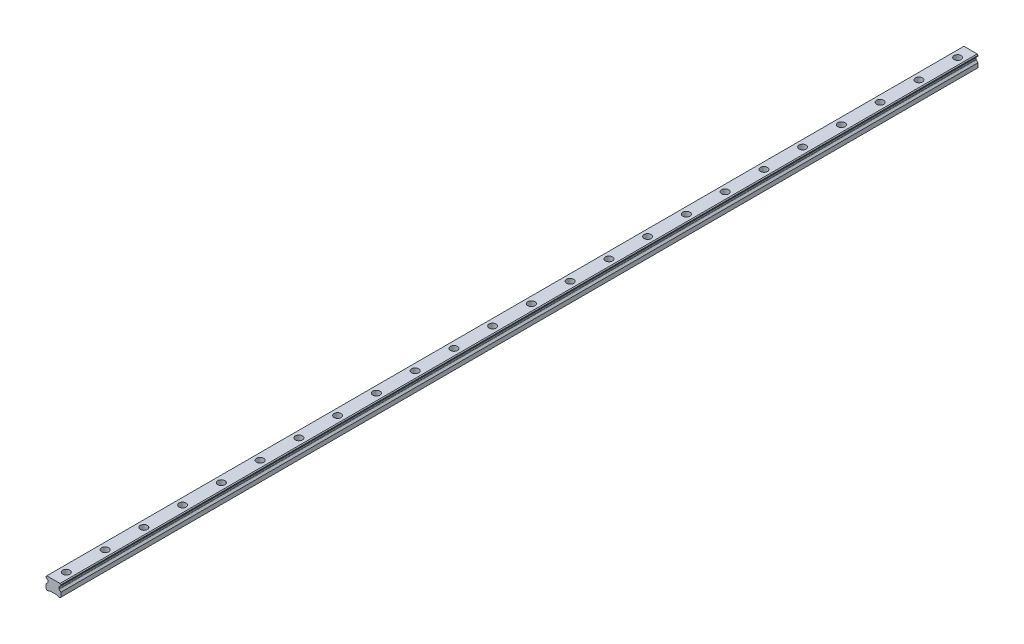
ISO-10303-21;
HEADER;
FILE_DESCRIPTION(('STEP AP214'),'2;1');
FILE_NAME('part.step','',(''),(''),'','','');
FILE_SCHEMA(('AUTOMOTIVE_DESIGN { 1 0 10303 214 1 1 1 1 }'));
ENDSEC;
DATA;
#1=APPLICATION_CONTEXT('core data for automotive mechanical design processes');
#2=APPLICATION_PROTOCOL_DEFINITION('international standard','automotive_design',2000,#1);
#3=PRODUCT_CONTEXT('',#1,'mechanical');
#4=PRODUCT('Part','Part','',(#3));
#5=PRODUCT_RELATED_PRODUCT_CATEGORY('part','',(#4));
#6=PRODUCT_DEFINITION_FORMATION('','',#4);
#7=PRODUCT_DEFINITION_CONTEXT('part definition',#1,'design');
#8=PRODUCT_DEFINITION('design','',#6,#7);
#9=PRODUCT_DEFINITION_SHAPE('','',#8);
#10=(LENGTH_UNIT() NAMED_UNIT(*) SI_UNIT(.MILLI.,.METRE.));
#11=(NAMED_UNIT(*) PLANE_ANGLE_UNIT() SI_UNIT($,.RADIAN.));
#12=(NAMED_UNIT(*) SI_UNIT($,.STERADIAN.) SOLID_ANGLE_UNIT());
#13=UNCERTAINTY_MEASURE_WITH_UNIT(LENGTH_MEASURE(1.E-05),#10,'distance_accuracy_value','');
#14=(GEOMETRIC_REPRESENTATION_CONTEXT(3) GLOBAL_UNCERTAINTY_ASSIGNED_CONTEXT((#13)) GLOBAL_UNIT_ASSIGNED_CONTEXT((#10,
#11,#12)) REPRESENTATION_CONTEXT('',''));
#15=CARTESIAN_POINT('',(0.,0.,0.));
#16=DIRECTION('',(0.,0.,1.));
#17=DIRECTION('',(1.,0.,0.));
#18=AXIS2_PLACEMENT_3D('',#15,#16,#17);
#19=CARTESIAN_POINT('',(0.,10.2,-690.));
#20=DIRECTION('',(0.,1.,0.));
#21=DIRECTION('',(0.,0.,1.));
#22=AXIS2_PLACEMENT_3D('',#19,#20,#21);
#23=PLANE('',#22);
#24=CARTESIAN_POINT('',(0.,10.2,-690.));
#25=DIRECTION('',(0.,1.,0.));
#26=DIRECTION('',(0.,0.,1.));
#27=AXIS2_PLACEMENT_3D('',#24,#25,#26);
#28=CIRCLE('',#27,3.5);
#29=CARTESIAN_POINT('',(0.,10.2,-686.5));
#30=VERTEX_POINT('',#29);
#31=EDGE_CURVE('E534',#30,#30,#28,.T.);
#32=ORIENTED_EDGE('',*,*,#31,.F.);
#33=EDGE_LOOP('',(#32));
#34=FACE_BOUND('',#33,.T.);
#35=CARTESIAN_POINT('',(0.,10.2,-690.));
#36=DIRECTION('',(0.,1.,0.));
#37=DIRECTION('',(0.,0.,1.));
#38=AXIS2_PLACEMENT_3D('',#35,#36,#37);
#39=CIRCLE('',#38,5.5);
#40=CARTESIAN_POINT('',(0.,10.2,-684.5));
#41=VERTEX_POINT('',#40);
#42=EDGE_CURVE('E11',#41,#41,#39,.T.);
#43=ORIENTED_EDGE('',*,*,#42,.T.);
#44=EDGE_LOOP('',(#43));
#45=FACE_BOUND('',#44,.T.);
#46=ADVANCED_FACE('F39',(#34,#45),#23,.T.);
#47=CARTESIAN_POINT('',(0.,10.2,-690.));
#48=DIRECTION('',(0.,1.,0.));
#49=DIRECTION('',(0.,0.,1.));
#50=AXIS2_PLACEMENT_3D('',#47,#48,#49);
#51=CYLINDRICAL_SURFACE('',#50,5.5);
#52=ORIENTED_EDGE('',*,*,#42,.F.);
#53=EDGE_LOOP('',(#52));
#54=FACE_BOUND('',#53,.T.);
#55=CARTESIAN_POINT('',(0.,19.2,-690.));
#56=DIRECTION('',(0.,1.,0.));
#57=DIRECTION('',(0.,0.,1.));
#58=AXIS2_PLACEMENT_3D('',#55,#56,#57);
#59=CIRCLE('',#58,5.5);
#60=CARTESIAN_POINT('',(0.,19.2,-684.5));
#61=VERTEX_POINT('',#60);
#62=EDGE_CURVE('E48',#61,#61,#59,.T.);
#63=ORIENTED_EDGE('',*,*,#62,.T.);
#64=EDGE_LOOP('',(#63));
#65=FACE_BOUND('',#64,.T.);
#66=ADVANCED_FACE('F931',(#54,#65),#51,.F.);
#67=CARTESIAN_POINT('',(0.,10.2,-630.));
#68=DIRECTION('',(0.,1.,0.));
#69=DIRECTION('',(0.,0.,1.));
#70=AXIS2_PLACEMENT_3D('',#67,#68,#69);
#71=PLANE('',#70);
#72=CARTESIAN_POINT('',(0.,10.2,-630.));
#73=DIRECTION('',(0.,1.,0.));
#74=DIRECTION('',(0.,0.,1.));
#75=AXIS2_PLACEMENT_3D('',#72,#73,#74);
#76=CIRCLE('',#75,3.5);
#77=CARTESIAN_POINT('',(0.,10.2,-626.5));
#78=VERTEX_POINT('',#77);
#79=EDGE_CURVE('E539',#78,#78,#76,.T.);
#80=ORIENTED_EDGE('',*,*,#79,.F.);
#81=EDGE_LOOP('',(#80));
#82=FACE_BOUND('',#81,.T.);
#83=CARTESIAN_POINT('',(0.,10.2,-630.));
#84=DIRECTION('',(0.,1.,0.));
#85=DIRECTION('',(0.,0.,1.));
#86=AXIS2_PLACEMENT_3D('',#83,#84,#85);
#87=CIRCLE('',#86,5.5);
#88=CARTESIAN_POINT('',(0.,10.2,-624.5));
#89=VERTEX_POINT('',#88);
#90=EDGE_CURVE('E518',#89,#89,#87,.T.);
#91=ORIENTED_EDGE('',*,*,#90,.T.);
#92=EDGE_LOOP('',(#91));
#93=FACE_BOUND('',#92,.T.);
#94=ADVANCED_FACE('F933',(#82,#93),#71,.T.);
#95=CARTESIAN_POINT('',(0.,10.2,-630.));
#96=DIRECTION('',(0.,1.,0.));
#97=DIRECTION('',(0.,0.,1.));
#98=AXIS2_PLACEMENT_3D('',#95,#96,#97);
#99=CYLINDRICAL_SURFACE('',#98,5.5);
#100=ORIENTED_EDGE('',*,*,#90,.F.);
#101=EDGE_LOOP('',(#100));
#102=FACE_BOUND('',#101,.T.);
#103=CARTESIAN_POINT('',(0.,19.2,-630.));
#104=DIRECTION('',(0.,1.,0.));
#105=DIRECTION('',(0.,0.,1.));
#106=AXIS2_PLACEMENT_3D('',#103,#104,#105);
#107=CIRCLE('',#106,5.5);
#108=CARTESIAN_POINT('',(0.,19.2,-624.5));
#109=VERTEX_POINT('',#108);
#110=EDGE_CURVE('E514',#109,#109,#107,.T.);
#111=ORIENTED_EDGE('',*,*,#110,.T.);
#112=EDGE_LOOP('',(#111));
#113=FACE_BOUND('',#112,.T.);
#114=ADVANCED_FACE('F939',(#102,#113),#99,.F.);
#115=CARTESIAN_POINT('',(0.,10.2,-570.));
#116=DIRECTION('',(0.,1.,0.));
#117=DIRECTION('',(0.,0.,1.));
#118=AXIS2_PLACEMENT_3D('',#115,#116,#117);
#119=PLANE('',#118);
#120=CARTESIAN_POINT('',(0.,10.2,-570.));
#121=DIRECTION('',(0.,1.,0.));
#122=DIRECTION('',(0.,0.,1.));
#123=AXIS2_PLACEMENT_3D('',#120,#121,#122);
#124=CIRCLE('',#123,3.5);
#125=CARTESIAN_POINT('',(0.,10.2,-566.5));
#126=VERTEX_POINT('',#125);
#127=EDGE_CURVE('E544',#126,#126,#124,.T.);
#128=ORIENTED_EDGE('',*,*,#127,.F.);
#129=EDGE_LOOP('',(#128));
#130=FACE_BOUND('',#129,.T.);
#131=CARTESIAN_POINT('',(0.,10.2,-570.));
#132=DIRECTION('',(0.,1.,0.));
#133=DIRECTION('',(0.,0.,1.));
#134=AXIS2_PLACEMENT_3D('',#131,#132,#133);
#135=CIRCLE('',#134,5.5);
#136=CARTESIAN_POINT('',(0.,10.2,-564.5));
#137=VERTEX_POINT('',#136);
#138=EDGE_CURVE('E510',#137,#137,#135,.T.);
#139=ORIENTED_EDGE('',*,*,#138,.T.);
#140=EDGE_LOOP('',(#139));
#141=FACE_BOUND('',#140,.T.);
#142=ADVANCED_FACE('F947',(#130,#141),#119,.T.);
#143=CARTESIAN_POINT('',(0.,10.2,-570.));
#144=DIRECTION('',(0.,1.,0.));
#145=DIRECTION('',(0.,0.,1.));
#146=AXIS2_PLACEMENT_3D('',#143,#144,#145);
#147=CYLINDRICAL_SURFACE('',#146,5.5);
#148=ORIENTED_EDGE('',*,*,#138,.F.);
#149=EDGE_LOOP('',(#148));
#150=FACE_BOUND('',#149,.T.);
#151=CARTESIAN_POINT('',(0.,19.2,-570.));
#152=DIRECTION('',(0.,1.,0.));
#153=DIRECTION('',(0.,0.,1.));
#154=AXIS2_PLACEMENT_3D('',#151,#152,#153);
#155=CIRCLE('',#154,5.5);
#156=CARTESIAN_POINT('',(0.,19.2,-564.5));
#157=VERTEX_POINT('',#156);
#158=EDGE_CURVE('E506',#157,#157,#155,.T.);
#159=ORIENTED_EDGE('',*,*,#158,.T.);
#160=EDGE_LOOP('',(#159));
#161=FACE_BOUND('',#160,.T.);
#162=ADVANCED_FACE('F951',(#150,#161),#147,.F.);
#163=CARTESIAN_POINT('',(0.,10.2,-510.));
#164=DIRECTION('',(0.,1.,0.));
#165=DIRECTION('',(0.,0.,1.));
#166=AXIS2_PLACEMENT_3D('',#163,#164,#165);
#167=PLANE('',#166);
#168=CARTESIAN_POINT('',(0.,10.2,-510.));
#169=DIRECTION('',(0.,1.,0.));
#170=DIRECTION('',(0.,0.,1.));
#171=AXIS2_PLACEMENT_3D('',#168,#169,#170);
#172=CIRCLE('',#171,3.5);
#173=CARTESIAN_POINT('',(0.,10.2,-506.5));
#174=VERTEX_POINT('',#173);
#175=EDGE_CURVE('E549',#174,#174,#172,.T.);
#176=ORIENTED_EDGE('',*,*,#175,.F.);
#177=EDGE_LOOP('',(#176));
#178=FACE_BOUND('',#177,.T.);
#179=CARTESIAN_POINT('',(0.,10.2,-510.));
#180=DIRECTION('',(0.,1.,0.));
#181=DIRECTION('',(0.,0.,1.));
#182=AXIS2_PLACEMENT_3D('',#179,#180,#181);
#183=CIRCLE('',#182,5.5);
#184=CARTESIAN_POINT('',(0.,10.2,-504.5));
#185=VERTEX_POINT('',#184);
#186=EDGE_CURVE('E502',#185,#185,#183,.T.);
#187=ORIENTED_EDGE('',*,*,#186,.T.);
#188=EDGE_LOOP('',(#187));
#189=FACE_BOUND('',#188,.T.);
#190=ADVANCED_FACE('F955',(#178,#189),#167,.T.);
#191=CARTESIAN_POINT('',(0.,10.2,-510.));
#192=DIRECTION('',(0.,1.,0.));
#193=DIRECTION('',(0.,0.,1.));
#194=AXIS2_PLACEMENT_3D('',#191,#192,#193);
#195=CYLINDRICAL_SURFACE('',#194,5.5);
#196=ORIENTED_EDGE('',*,*,#186,.F.);
#197=EDGE_LOOP('',(#196));
#198=FACE_BOUND('',#197,.T.);
#199=CARTESIAN_POINT('',(0.,19.2,-510.));
#200=DIRECTION('',(0.,1.,0.));
#201=DIRECTION('',(0.,0.,1.));
#202=AXIS2_PLACEMENT_3D('',#199,#200,#201);
#203=CIRCLE('',#202,5.5);
#204=CARTESIAN_POINT('',(0.,19.2,-504.5));
#205=VERTEX_POINT('',#204);
#206=EDGE_CURVE('E498',#205,#205,#203,.T.);
#207=ORIENTED_EDGE('',*,*,#206,.T.);
#208=EDGE_LOOP('',(#207));
#209=FACE_BOUND('',#208,.T.);
#210=ADVANCED_FACE('F959',(#198,#209),#195,.F.);
#211=CARTESIAN_POINT('',(0.,10.2,-450.));
#212=DIRECTION('',(0.,1.,0.));
#213=DIRECTION('',(0.,0.,1.));
#214=AXIS2_PLACEMENT_3D('',#211,#212,#213);
#215=PLANE('',#214);
#216=CARTESIAN_POINT('',(0.,10.2,-450.));
#217=DIRECTION('',(0.,1.,0.));
#218=DIRECTION('',(0.,0.,1.));
#219=AXIS2_PLACEMENT_3D('',#216,#217,#218);
#220=CIRCLE('',#219,3.5);
#221=CARTESIAN_POINT('',(0.,10.2,-446.5));
#222=VERTEX_POINT('',#221);
#223=EDGE_CURVE('E554',#222,#222,#220,.T.);
#224=ORIENTED_EDGE('',*,*,#223,.F.);
#225=EDGE_LOOP('',(#224));
#226=FACE_BOUND('',#225,.T.);
#227=CARTESIAN_POINT('',(0.,10.2,-450.));
#228=DIRECTION('',(0.,1.,0.));
#229=DIRECTION('',(0.,0.,1.));
#230=AXIS2_PLACEMENT_3D('',#227,#228,#229);
#231=CIRCLE('',#230,5.5);
#232=CARTESIAN_POINT('',(0.,10.2,-444.5));
#233=VERTEX_POINT('',#232);
#234=EDGE_CURVE('E494',#233,#233,#231,.T.);
#235=ORIENTED_EDGE('',*,*,#234,.T.);
#236=EDGE_LOOP('',(#235));
#237=FACE_BOUND('',#236,.T.);
#238=ADVANCED_FACE('F963',(#226,#237),#215,.T.);
#239=CARTESIAN_POINT('',(0.,10.2,-450.));
#240=DIRECTION('',(0.,1.,0.));
#241=DIRECTION('',(0.,0.,1.));
#242=AXIS2_PLACEMENT_3D('',#239,#240,#241);
#243=CYLINDRICAL_SURFACE('',#242,5.5);
#244=ORIENTED_EDGE('',*,*,#234,.F.);
#245=EDGE_LOOP('',(#244));
#246=FACE_BOUND('',#245,.T.);
#247=CARTESIAN_POINT('',(0.,19.2,-450.));
#248=DIRECTION('',(0.,1.,0.));
#249=DIRECTION('',(0.,0.,1.));
#250=AXIS2_PLACEMENT_3D('',#247,#248,#249);
#251=CIRCLE('',#250,5.5);
#252=CARTESIAN_POINT('',(0.,19.2,-444.5));
#253=VERTEX_POINT('',#252);
#254=EDGE_CURVE('E490',#253,#253,#251,.T.);
#255=ORIENTED_EDGE('',*,*,#254,.T.);
#256=EDGE_LOOP('',(#255));
#257=FACE_BOUND('',#256,.T.);
#258=ADVANCED_FACE('F967',(#246,#257),#243,.F.);
#259=CARTESIAN_POINT('',(0.,10.2,-390.));
#260=DIRECTION('',(0.,1.,0.));
#261=DIRECTION('',(0.,0.,1.));
#262=AXIS2_PLACEMENT_3D('',#259,#260,#261);
#263=PLANE('',#262);
#264=CARTESIAN_POINT('',(0.,10.2,-390.));
#265=DIRECTION('',(0.,1.,0.));
#266=DIRECTION('',(0.,0.,1.));
#267=AXIS2_PLACEMENT_3D('',#264,#265,#266);
#268=CIRCLE('',#267,3.5);
#269=CARTESIAN_POINT('',(0.,10.2,-386.5));
#270=VERTEX_POINT('',#269);
#271=EDGE_CURVE('E559',#270,#270,#268,.T.);
#272=ORIENTED_EDGE('',*,*,#271,.F.);
#273=EDGE_LOOP('',(#272));
#274=FACE_BOUND('',#273,.T.);
#275=CARTESIAN_POINT('',(0.,10.2,-390.));
#276=DIRECTION('',(0.,1.,0.));
#277=DIRECTION('',(0.,0.,1.));
#278=AXIS2_PLACEMENT_3D('',#275,#276,#277);
#279=CIRCLE('',#278,5.5);
#280=CARTESIAN_POINT('',(0.,10.2,-384.5));
#281=VERTEX_POINT('',#280);
#282=EDGE_CURVE('E486',#281,#281,#279,.T.);
#283=ORIENTED_EDGE('',*,*,#282,.T.);
#284=EDGE_LOOP('',(#283));
#285=FACE_BOUND('',#284,.T.);
#286=ADVANCED_FACE('F971',(#274,#285),#263,.T.);
#287=CARTESIAN_POINT('',(0.,10.2,-390.));
#288=DIRECTION('',(0.,1.,0.));
#289=DIRECTION('',(0.,0.,1.));
#290=AXIS2_PLACEMENT_3D('',#287,#288,#289);
#291=CYLINDRICAL_SURFACE('',#290,5.5);
#292=ORIENTED_EDGE('',*,*,#282,.F.);
#293=EDGE_LOOP('',(#292));
#294=FACE_BOUND('',#293,.T.);
#295=CARTESIAN_POINT('',(0.,19.2,-390.));
#296=DIRECTION('',(0.,1.,0.));
#297=DIRECTION('',(0.,0.,1.));
#298=AXIS2_PLACEMENT_3D('',#295,#296,#297);
#299=CIRCLE('',#298,5.5);
#300=CARTESIAN_POINT('',(0.,19.2,-384.5));
#301=VERTEX_POINT('',#300);
#302=EDGE_CURVE('E482',#301,#301,#299,.T.);
#303=ORIENTED_EDGE('',*,*,#302,.T.);
#304=EDGE_LOOP('',(#303));
#305=FACE_BOUND('',#304,.T.);
#306=ADVANCED_FACE('F975',(#294,#305),#291,.F.);
#307=CARTESIAN_POINT('',(0.,10.2,-330.));
#308=DIRECTION('',(0.,1.,0.));
#309=DIRECTION('',(0.,0.,1.));
#310=AXIS2_PLACEMENT_3D('',#307,#308,#309);
#311=PLANE('',#310);
#312=CARTESIAN_POINT('',(0.,10.2,-330.));
#313=DIRECTION('',(0.,1.,0.));
#314=DIRECTION('',(0.,0.,1.));
#315=AXIS2_PLACEMENT_3D('',#312,#313,#314);
#316=CIRCLE('',#315,3.5);
#317=CARTESIAN_POINT('',(0.,10.2,-326.5));
#318=VERTEX_POINT('',#317);
#319=EDGE_CURVE('E564',#318,#318,#316,.T.);
#320=ORIENTED_EDGE('',*,*,#319,.F.);
#321=EDGE_LOOP('',(#320));
#322=FACE_BOUND('',#321,.T.);
#323=CARTESIAN_POINT('',(0.,10.2,-330.));
#324=DIRECTION('',(0.,1.,0.));
#325=DIRECTION('',(0.,0.,1.));
#326=AXIS2_PLACEMENT_3D('',#323,#324,#325);
#327=CIRCLE('',#326,5.5);
#328=CARTESIAN_POINT('',(0.,10.2,-324.5));
#329=VERTEX_POINT('',#328);
#330=EDGE_CURVE('E478',#329,#329,#327,.T.);
#331=ORIENTED_EDGE('',*,*,#330,.T.);
#332=EDGE_LOOP('',(#331));
#333=FACE_BOUND('',#332,.T.);
#334=ADVANCED_FACE('F979',(#322,#333),#311,.T.);
#335=CARTESIAN_POINT('',(0.,10.2,-330.));
#336=DIRECTION('',(0.,1.,0.));
#337=DIRECTION('',(0.,0.,1.));
#338=AXIS2_PLACEMENT_3D('',#335,#336,#337);
#339=CYLINDRICAL_SURFACE('',#338,5.5);
#340=ORIENTED_EDGE('',*,*,#330,.F.);
#341=EDGE_LOOP('',(#340));
#342=FACE_BOUND('',#341,.T.);
#343=CARTESIAN_POINT('',(0.,19.2,-330.));
#344=DIRECTION('',(0.,1.,0.));
#345=DIRECTION('',(0.,0.,1.));
#346=AXIS2_PLACEMENT_3D('',#343,#344,#345);
#347=CIRCLE('',#346,5.5);
#348=CARTESIAN_POINT('',(0.,19.2,-324.5));
#349=VERTEX_POINT('',#348);
#350=EDGE_CURVE('E474',#349,#349,#347,.T.);
#351=ORIENTED_EDGE('',*,*,#350,.T.);
#352=EDGE_LOOP('',(#351));
#353=FACE_BOUND('',#352,.T.);
#354=ADVANCED_FACE('F983',(#342,#353),#339,.F.);
#355=CARTESIAN_POINT('',(0.,10.2,-270.));
#356=DIRECTION('',(0.,1.,0.));
#357=DIRECTION('',(0.,0.,1.));
#358=AXIS2_PLACEMENT_3D('',#355,#356,#357);
#359=PLANE('',#358);
#360=CARTESIAN_POINT('',(0.,10.2,-270.));
#361=DIRECTION('',(0.,1.,0.));
#362=DIRECTION('',(0.,0.,1.));
#363=AXIS2_PLACEMENT_3D('',#360,#361,#362);
#364=CIRCLE('',#363,3.5);
#365=CARTESIAN_POINT('',(0.,10.2,-266.5));
#366=VERTEX_POINT('',#365);
#367=EDGE_CURVE('E569',#366,#366,#364,.T.);
#368=ORIENTED_EDGE('',*,*,#367,.F.);
#369=EDGE_LOOP('',(#368));
#370=FACE_BOUND('',#369,.T.);
#371=CARTESIAN_POINT('',(0.,10.2,-270.));
#372=DIRECTION('',(0.,1.,0.));
#373=DIRECTION('',(0.,0.,1.));
#374=AXIS2_PLACEMENT_3D('',#371,#372,#373);
#375=CIRCLE('',#374,5.5);
#376=CARTESIAN_POINT('',(0.,10.2,-264.5));
#377=VERTEX_POINT('',#376);
#378=EDGE_CURVE('E470',#377,#377,#375,.T.);
#379=ORIENTED_EDGE('',*,*,#378,.T.);
#380=EDGE_LOOP('',(#379));
#381=FACE_BOUND('',#380,.T.);
#382=ADVANCED_FACE('F987',(#370,#381),#359,.T.);
#383=CARTESIAN_POINT('',(0.,10.2,-270.));
#384=DIRECTION('',(0.,1.,0.));
#385=DIRECTION('',(0.,0.,1.));
#386=AXIS2_PLACEMENT_3D('',#383,#384,#385);
#387=CYLINDRICAL_SURFACE('',#386,5.5);
#388=ORIENTED_EDGE('',*,*,#378,.F.);
#389=EDGE_LOOP('',(#388));
#390=FACE_BOUND('',#389,.T.);
#391=CARTESIAN_POINT('',(0.,19.2,-270.));
#392=DIRECTION('',(0.,1.,0.));
#393=DIRECTION('',(0.,0.,1.));
#394=AXIS2_PLACEMENT_3D('',#391,#392,#393);
#395=CIRCLE('',#394,5.5);
#396=CARTESIAN_POINT('',(0.,19.2,-264.5));
#397=VERTEX_POINT('',#396);
#398=EDGE_CURVE('E466',#397,#397,#395,.T.);
#399=ORIENTED_EDGE('',*,*,#398,.T.);
#400=EDGE_LOOP('',(#399));
#401=FACE_BOUND('',#400,.T.);
#402=ADVANCED_FACE('F991',(#390,#401),#387,.F.);
#403=CARTESIAN_POINT('',(0.,10.2,-210.));
#404=DIRECTION('',(0.,1.,0.));
#405=DIRECTION('',(0.,0.,1.));
#406=AXIS2_PLACEMENT_3D('',#403,#404,#405);
#407=PLANE('',#406);
#408=CARTESIAN_POINT('',(0.,10.2,-210.));
#409=DIRECTION('',(0.,1.,0.));
#410=DIRECTION('',(0.,0.,1.));
#411=AXIS2_PLACEMENT_3D('',#408,#409,#410);
#412=CIRCLE('',#411,3.5);
#413=CARTESIAN_POINT('',(0.,10.2,-206.5));
#414=VERTEX_POINT('',#413);
#415=EDGE_CURVE('E574',#414,#414,#412,.T.);
#416=ORIENTED_EDGE('',*,*,#415,.F.);
#417=EDGE_LOOP('',(#416));
#418=FACE_BOUND('',#417,.T.);
#419=CARTESIAN_POINT('',(0.,10.2,-210.));
#420=DIRECTION('',(0.,1.,0.));
#421=DIRECTION('',(0.,0.,1.));
#422=AXIS2_PLACEMENT_3D('',#419,#420,#421);
#423=CIRCLE('',#422,5.5);
#424=CARTESIAN_POINT('',(0.,10.2,-204.5));
#425=VERTEX_POINT('',#424);
#426=EDGE_CURVE('E462',#425,#425,#423,.T.);
#427=ORIENTED_EDGE('',*,*,#426,.T.);
#428=EDGE_LOOP('',(#427));
#429=FACE_BOUND('',#428,.T.);
#430=ADVANCED_FACE('F995',(#418,#429),#407,.T.);
#431=CARTESIAN_POINT('',(0.,10.2,-210.));
#432=DIRECTION('',(0.,1.,0.));
#433=DIRECTION('',(0.,0.,1.));
#434=AXIS2_PLACEMENT_3D('',#431,#432,#433);
#435=CYLINDRICAL_SURFACE('',#434,5.5);
#436=ORIENTED_EDGE('',*,*,#426,.F.);
#437=EDGE_LOOP('',(#436));
#438=FACE_BOUND('',#437,.T.);
#439=CARTESIAN_POINT('',(0.,19.2,-210.));
#440=DIRECTION('',(0.,1.,0.));
#441=DIRECTION('',(0.,0.,1.));
#442=AXIS2_PLACEMENT_3D('',#439,#440,#441);
#443=CIRCLE('',#442,5.5);
#444=CARTESIAN_POINT('',(0.,19.2,-204.5));
#445=VERTEX_POINT('',#444);
#446=EDGE_CURVE('E458',#445,#445,#443,.T.);
#447=ORIENTED_EDGE('',*,*,#446,.T.);
#448=EDGE_LOOP('',(#447));
#449=FACE_BOUND('',#448,.T.);
#450=ADVANCED_FACE('F999',(#438,#449),#435,.F.);
#451=CARTESIAN_POINT('',(0.,10.2,-150.));
#452=DIRECTION('',(0.,1.,0.));
#453=DIRECTION('',(0.,0.,1.));
#454=AXIS2_PLACEMENT_3D('',#451,#452,#453);
#455=PLANE('',#454);
#456=CARTESIAN_POINT('',(0.,10.2,-150.));
#457=DIRECTION('',(0.,1.,0.));
#458=DIRECTION('',(0.,0.,1.));
#459=AXIS2_PLACEMENT_3D('',#456,#457,#458);
#460=CIRCLE('',#459,3.5);
#461=CARTESIAN_POINT('',(0.,10.2,-146.5));
#462=VERTEX_POINT('',#461);
#463=EDGE_CURVE('E579',#462,#462,#460,.T.);
#464=ORIENTED_EDGE('',*,*,#463,.F.);
#465=EDGE_LOOP('',(#464));
#466=FACE_BOUND('',#465,.T.);
#467=CARTESIAN_POINT('',(0.,10.2,-150.));
#468=DIRECTION('',(0.,1.,0.));
#469=DIRECTION('',(0.,0.,1.));
#470=AXIS2_PLACEMENT_3D('',#467,#468,#469);
#471=CIRCLE('',#470,5.5);
#472=CARTESIAN_POINT('',(0.,10.2,-144.5));
#473=VERTEX_POINT('',#472);
#474=EDGE_CURVE('E454',#473,#473,#471,.T.);
#475=ORIENTED_EDGE('',*,*,#474,.T.);
#476=EDGE_LOOP('',(#475));
#477=FACE_BOUND('',#476,.T.);
#478=ADVANCED_FACE('F1003',(#466,#477),#455,.T.);
#479=CARTESIAN_POINT('',(0.,10.2,-150.));
#480=DIRECTION('',(0.,1.,0.));
#481=DIRECTION('',(0.,0.,1.));
#482=AXIS2_PLACEMENT_3D('',#479,#480,#481);
#483=CYLINDRICAL_SURFACE('',#482,5.5);
#484=ORIENTED_EDGE('',*,*,#474,.F.);
#485=EDGE_LOOP('',(#484));
#486=FACE_BOUND('',#485,.T.);
#487=CARTESIAN_POINT('',(0.,19.2,-150.));
#488=DIRECTION('',(0.,1.,0.));
#489=DIRECTION('',(0.,0.,1.));
#490=AXIS2_PLACEMENT_3D('',#487,#488,#489);
#491=CIRCLE('',#490,5.5);
#492=CARTESIAN_POINT('',(0.,19.2,-144.5));
#493=VERTEX_POINT('',#492);
#494=EDGE_CURVE('E450',#493,#493,#491,.T.);
#495=ORIENTED_EDGE('',*,*,#494,.T.);
#496=EDGE_LOOP('',(#495));
#497=FACE_BOUND('',#496,.T.);
#498=ADVANCED_FACE('F1007',(#486,#497),#483,.F.);
#499=CARTESIAN_POINT('',(0.,10.2,-90.0000000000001));
#500=DIRECTION('',(0.,1.,0.));
#501=DIRECTION('',(0.,0.,1.));
#502=AXIS2_PLACEMENT_3D('',#499,#500,#501);
#503=PLANE('',#502);
#504=CARTESIAN_POINT('',(0.,10.2,-90.0000000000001));
#505=DIRECTION('',(0.,1.,0.));
#506=DIRECTION('',(0.,0.,1.));
#507=AXIS2_PLACEMENT_3D('',#504,#505,#506);
#508=CIRCLE('',#507,3.5);
#509=CARTESIAN_POINT('',(0.,10.2,-86.5000000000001));
#510=VERTEX_POINT('',#509);
#511=EDGE_CURVE('E584',#510,#510,#508,.T.);
#512=ORIENTED_EDGE('',*,*,#511,.F.);
#513=EDGE_LOOP('',(#512));
#514=FACE_BOUND('',#513,.T.);
#515=CARTESIAN_POINT('',(0.,10.2,-90.0000000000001));
#516=DIRECTION('',(0.,1.,0.));
#517=DIRECTION('',(0.,0.,1.));
#518=AXIS2_PLACEMENT_3D('',#515,#516,#517);
#519=CIRCLE('',#518,5.5);
#520=CARTESIAN_POINT('',(0.,10.2,-84.5000000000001));
#521=VERTEX_POINT('',#520);
#522=EDGE_CURVE('E446',#521,#521,#519,.T.);
#523=ORIENTED_EDGE('',*,*,#522,.T.);
#524=EDGE_LOOP('',(#523));
#525=FACE_BOUND('',#524,.T.);
#526=ADVANCED_FACE('F1011',(#514,#525),#503,.T.);
#527=CARTESIAN_POINT('',(0.,10.2,-90.0000000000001));
#528=DIRECTION('',(0.,1.,0.));
#529=DIRECTION('',(0.,0.,1.));
#530=AXIS2_PLACEMENT_3D('',#527,#528,#529);
#531=CYLINDRICAL_SURFACE('',#530,5.5);
#532=ORIENTED_EDGE('',*,*,#522,.F.);
#533=EDGE_LOOP('',(#532));
#534=FACE_BOUND('',#533,.T.);
#535=CARTESIAN_POINT('',(0.,19.2,-90.0000000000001));
#536=DIRECTION('',(0.,1.,0.));
#537=DIRECTION('',(0.,0.,1.));
#538=AXIS2_PLACEMENT_3D('',#535,#536,#537);
#539=CIRCLE('',#538,5.5);
#540=CARTESIAN_POINT('',(0.,19.2,-84.5000000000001));
#541=VERTEX_POINT('',#540);
#542=EDGE_CURVE('E442',#541,#541,#539,.T.);
#543=ORIENTED_EDGE('',*,*,#542,.T.);
#544=EDGE_LOOP('',(#543));
#545=FACE_BOUND('',#544,.T.);
#546=ADVANCED_FACE('F1015',(#534,#545),#531,.F.);
#547=CARTESIAN_POINT('',(0.,10.2,-30.));
#548=DIRECTION('',(0.,1.,0.));
#549=DIRECTION('',(0.,0.,1.));
#550=AXIS2_PLACEMENT_3D('',#547,#548,#549);
#551=PLANE('',#550);
#552=CARTESIAN_POINT('',(0.,10.2,-30.));
#553=DIRECTION('',(0.,1.,0.));
#554=DIRECTION('',(0.,0.,1.));
#555=AXIS2_PLACEMENT_3D('',#552,#553,#554);
#556=CIRCLE('',#555,3.5);
#557=CARTESIAN_POINT('',(0.,10.2,-26.5));
#558=VERTEX_POINT('',#557);
#559=EDGE_CURVE('E589',#558,#558,#556,.T.);
#560=ORIENTED_EDGE('',*,*,#559,.F.);
#561=EDGE_LOOP('',(#560));
#562=FACE_BOUND('',#561,.T.);
#563=CARTESIAN_POINT('',(0.,10.2,-30.));
#564=DIRECTION('',(0.,1.,0.));
#565=DIRECTION('',(0.,0.,1.));
#566=AXIS2_PLACEMENT_3D('',#563,#564,#565);
#567=CIRCLE('',#566,5.5);
#568=CARTESIAN_POINT('',(0.,10.2,-24.5));
#569=VERTEX_POINT('',#568);
#570=EDGE_CURVE('E438',#569,#569,#567,.T.);
#571=ORIENTED_EDGE('',*,*,#570,.T.);
#572=EDGE_LOOP('',(#571));
#573=FACE_BOUND('',#572,.T.);
#574=ADVANCED_FACE('F1019',(#562,#573),#551,.T.);
#575=CARTESIAN_POINT('',(0.,10.2,-30.));
#576=DIRECTION('',(0.,1.,0.));
#577=DIRECTION('',(0.,0.,1.));
#578=AXIS2_PLACEMENT_3D('',#575,#576,#577);
#579=CYLINDRICAL_SURFACE('',#578,5.5);
#580=ORIENTED_EDGE('',*,*,#570,.F.);
#581=EDGE_LOOP('',(#580));
#582=FACE_BOUND('',#581,.T.);
#583=CARTESIAN_POINT('',(0.,19.2,-30.));
#584=DIRECTION('',(0.,1.,0.));
#585=DIRECTION('',(0.,0.,1.));
#586=AXIS2_PLACEMENT_3D('',#583,#584,#585);
#587=CIRCLE('',#586,5.5);
#588=CARTESIAN_POINT('',(0.,19.2,-24.5));
#589=VERTEX_POINT('',#588);
#590=EDGE_CURVE('E434',#589,#589,#587,.T.);
#591=ORIENTED_EDGE('',*,*,#590,.T.);
#592=EDGE_LOOP('',(#591));
#593=FACE_BOUND('',#592,.T.);
#594=ADVANCED_FACE('F1023',(#582,#593),#579,.F.);
#595=CARTESIAN_POINT('',(0.,10.2,30.));
#596=DIRECTION('',(0.,1.,0.));
#597=DIRECTION('',(0.,0.,1.));
#598=AXIS2_PLACEMENT_3D('',#595,#596,#597);
#599=PLANE('',#598);
#600=CARTESIAN_POINT('',(0.,10.2,30.));
#601=DIRECTION('',(0.,1.,0.));
#602=DIRECTION('',(0.,0.,1.));
#603=AXIS2_PLACEMENT_3D('',#600,#601,#602);
#604=CIRCLE('',#603,3.5);
#605=CARTESIAN_POINT('',(0.,10.2,33.5));
#606=VERTEX_POINT('',#605);
#607=EDGE_CURVE('E594',#606,#606,#604,.T.);
#608=ORIENTED_EDGE('',*,*,#607,.F.);
#609=EDGE_LOOP('',(#608));
#610=FACE_BOUND('',#609,.T.);
#611=CARTESIAN_POINT('',(0.,10.2,30.));
#612=DIRECTION('',(0.,1.,0.));
#613=DIRECTION('',(0.,0.,1.));
#614=AXIS2_PLACEMENT_3D('',#611,#612,#613);
#615=CIRCLE('',#614,5.5);
#616=CARTESIAN_POINT('',(0.,10.2,35.5));
#617=VERTEX_POINT('',#616);
#618=EDGE_CURVE('E430',#617,#617,#615,.T.);
#619=ORIENTED_EDGE('',*,*,#618,.T.);
#620=EDGE_LOOP('',(#619));
#621=FACE_BOUND('',#620,.T.);
#622=ADVANCED_FACE('F1027',(#610,#621),#599,.T.);
#623=CARTESIAN_POINT('',(0.,10.2,30.));
#624=DIRECTION('',(0.,1.,0.));
#625=DIRECTION('',(0.,0.,1.));
#626=AXIS2_PLACEMENT_3D('',#623,#624,#625);
#627=CYLINDRICAL_SURFACE('',#626,5.5);
#628=ORIENTED_EDGE('',*,*,#618,.F.);
#629=EDGE_LOOP('',(#628));
#630=FACE_BOUND('',#629,.T.);
#631=CARTESIAN_POINT('',(0.,19.2,30.));
#632=DIRECTION('',(0.,1.,0.));
#633=DIRECTION('',(0.,0.,1.));
#634=AXIS2_PLACEMENT_3D('',#631,#632,#633);
#635=CIRCLE('',#634,5.5);
#636=CARTESIAN_POINT('',(0.,19.2,35.5));
#637=VERTEX_POINT('',#636);
#638=EDGE_CURVE('E426',#637,#637,#635,.T.);
#639=ORIENTED_EDGE('',*,*,#638,.T.);
#640=EDGE_LOOP('',(#639));
#641=FACE_BOUND('',#640,.T.);
#642=ADVANCED_FACE('F1031',(#630,#641),#627,.F.);
#643=CARTESIAN_POINT('',(0.,10.2,89.9999999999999));
#644=DIRECTION('',(0.,1.,0.));
#645=DIRECTION('',(0.,0.,1.));
#646=AXIS2_PLACEMENT_3D('',#643,#644,#645);
#647=PLANE('',#646);
#648=CARTESIAN_POINT('',(0.,10.2,90.));
#649=DIRECTION('',(0.,1.,0.));
#650=DIRECTION('',(0.,0.,1.));
#651=AXIS2_PLACEMENT_3D('',#648,#649,#650);
#652=CIRCLE('',#651,3.5);
#653=CARTESIAN_POINT('',(0.,10.2,93.5));
#654=VERTEX_POINT('',#653);
#655=EDGE_CURVE('E599',#654,#654,#652,.T.);
#656=ORIENTED_EDGE('',*,*,#655,.F.);
#657=EDGE_LOOP('',(#656));
#658=FACE_BOUND('',#657,.T.);
#659=CARTESIAN_POINT('',(0.,10.2,89.9999999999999));
#660=DIRECTION('',(0.,1.,0.));
#661=DIRECTION('',(0.,0.,1.));
#662=AXIS2_PLACEMENT_3D('',#659,#660,#661);
#663=CIRCLE('',#662,5.5);
#664=CARTESIAN_POINT('',(0.,10.2,95.4999999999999));
#665=VERTEX_POINT('',#664);
#666=EDGE_CURVE('E422',#665,#665,#663,.T.);
#667=ORIENTED_EDGE('',*,*,#666,.T.);
#668=EDGE_LOOP('',(#667));
#669=FACE_BOUND('',#668,.T.);
#670=ADVANCED_FACE('F1035',(#658,#669),#647,.T.);
#671=CARTESIAN_POINT('',(0.,10.2,89.9999999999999));
#672=DIRECTION('',(0.,1.,0.));
#673=DIRECTION('',(0.,0.,1.));
#674=AXIS2_PLACEMENT_3D('',#671,#672,#673);
#675=CYLINDRICAL_SURFACE('',#674,5.5);
#676=ORIENTED_EDGE('',*,*,#666,.F.);
#677=EDGE_LOOP('',(#676));
#678=FACE_BOUND('',#677,.T.);
#679=CARTESIAN_POINT('',(0.,19.2,89.9999999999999));
#680=DIRECTION('',(0.,1.,0.));
#681=DIRECTION('',(0.,0.,1.));
#682=AXIS2_PLACEMENT_3D('',#679,#680,#681);
#683=CIRCLE('',#682,5.5);
#684=CARTESIAN_POINT('',(0.,19.2,95.4999999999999));
#685=VERTEX_POINT('',#684);
#686=EDGE_CURVE('E418',#685,#685,#683,.T.);
#687=ORIENTED_EDGE('',*,*,#686,.T.);
#688=EDGE_LOOP('',(#687));
#689=FACE_BOUND('',#688,.T.);
#690=ADVANCED_FACE('F1039',(#678,#689),#675,.F.);
#691=CARTESIAN_POINT('',(0.,10.2,150.));
#692=DIRECTION('',(0.,1.,0.));
#693=DIRECTION('',(0.,0.,1.));
#694=AXIS2_PLACEMENT_3D('',#691,#692,#693);
#695=PLANE('',#694);
#696=CARTESIAN_POINT('',(0.,10.2,150.));
#697=DIRECTION('',(0.,1.,0.));
#698=DIRECTION('',(0.,0.,1.));
#699=AXIS2_PLACEMENT_3D('',#696,#697,#698);
#700=CIRCLE('',#699,3.5);
#701=CARTESIAN_POINT('',(0.,10.2,153.5));
#702=VERTEX_POINT('',#701);
#703=EDGE_CURVE('E604',#702,#702,#700,.T.);
#704=ORIENTED_EDGE('',*,*,#703,.F.);
#705=EDGE_LOOP('',(#704));
#706=FACE_BOUND('',#705,.T.);
#707=CARTESIAN_POINT('',(0.,10.2,150.));
#708=DIRECTION('',(0.,1.,0.));
#709=DIRECTION('',(0.,0.,1.));
#710=AXIS2_PLACEMENT_3D('',#707,#708,#709);
#711=CIRCLE('',#710,5.5);
#712=CARTESIAN_POINT('',(0.,10.2,155.5));
#713=VERTEX_POINT('',#712);
#714=EDGE_CURVE('E414',#713,#713,#711,.T.);
#715=ORIENTED_EDGE('',*,*,#714,.T.);
#716=EDGE_LOOP('',(#715));
#717=FACE_BOUND('',#716,.T.);
#718=ADVANCED_FACE('F1043',(#706,#717),#695,.T.);
#719=CARTESIAN_POINT('',(0.,10.2,150.));
#720=DIRECTION('',(0.,1.,0.));
#721=DIRECTION('',(0.,0.,1.));
#722=AXIS2_PLACEMENT_3D('',#719,#720,#721);
#723=CYLINDRICAL_SURFACE('',#722,5.5);
#724=ORIENTED_EDGE('',*,*,#714,.F.);
#725=EDGE_LOOP('',(#724));
#726=FACE_BOUND('',#725,.T.);
#727=CARTESIAN_POINT('',(0.,19.2,150.));
#728=DIRECTION('',(0.,1.,0.));
#729=DIRECTION('',(0.,0.,1.));
#730=AXIS2_PLACEMENT_3D('',#727,#728,#729);
#731=CIRCLE('',#730,5.5);
#732=CARTESIAN_POINT('',(0.,19.2,155.5));
#733=VERTEX_POINT('',#732);
#734=EDGE_CURVE('E410',#733,#733,#731,.T.);
#735=ORIENTED_EDGE('',*,*,#734,.T.);
#736=EDGE_LOOP('',(#735));
#737=FACE_BOUND('',#736,.T.);
#738=ADVANCED_FACE('F1047',(#726,#737),#723,.F.);
#739=CARTESIAN_POINT('',(0.,10.2,210.));
#740=DIRECTION('',(0.,1.,0.));
#741=DIRECTION('',(0.,0.,1.));
#742=AXIS2_PLACEMENT_3D('',#739,#740,#741);
#743=PLANE('',#742);
#744=CARTESIAN_POINT('',(0.,10.2,210.));
#745=DIRECTION('',(0.,1.,0.));
#746=DIRECTION('',(0.,0.,1.));
#747=AXIS2_PLACEMENT_3D('',#744,#745,#746);
#748=CIRCLE('',#747,3.5);
#749=CARTESIAN_POINT('',(0.,10.2,213.5));
#750=VERTEX_POINT('',#749);
#751=EDGE_CURVE('E609',#750,#750,#748,.T.);
#752=ORIENTED_EDGE('',*,*,#751,.F.);
#753=EDGE_LOOP('',(#752));
#754=FACE_BOUND('',#753,.T.);
#755=CARTESIAN_POINT('',(0.,10.2,210.));
#756=DIRECTION('',(0.,1.,0.));
#757=DIRECTION('',(0.,0.,1.));
#758=AXIS2_PLACEMENT_3D('',#755,#756,#757);
#759=CIRCLE('',#758,5.5);
#760=CARTESIAN_POINT('',(0.,10.2,215.5));
#761=VERTEX_POINT('',#760);
#762=EDGE_CURVE('E406',#761,#761,#759,.T.);
#763=ORIENTED_EDGE('',*,*,#762,.T.);
#764=EDGE_LOOP('',(#763));
#765=FACE_BOUND('',#764,.T.);
#766=ADVANCED_FACE('F1051',(#754,#765),#743,.T.);
#767=CARTESIAN_POINT('',(0.,10.2,210.));
#768=DIRECTION('',(0.,1.,0.));
#769=DIRECTION('',(0.,0.,1.));
#770=AXIS2_PLACEMENT_3D('',#767,#768,#769);
#771=CYLINDRICAL_SURFACE('',#770,5.5);
#772=ORIENTED_EDGE('',*,*,#762,.F.);
#773=EDGE_LOOP('',(#772));
#774=FACE_BOUND('',#773,.T.);
#775=CARTESIAN_POINT('',(0.,19.2,210.));
#776=DIRECTION('',(0.,1.,0.));
#777=DIRECTION('',(0.,0.,1.));
#778=AXIS2_PLACEMENT_3D('',#775,#776,#777);
#779=CIRCLE('',#778,5.5);
#780=CARTESIAN_POINT('',(0.,19.2,215.5));
#781=VERTEX_POINT('',#780);
#782=EDGE_CURVE('E402',#781,#781,#779,.T.);
#783=ORIENTED_EDGE('',*,*,#782,.T.);
#784=EDGE_LOOP('',(#783));
#785=FACE_BOUND('',#784,.T.);
#786=ADVANCED_FACE('F1055',(#774,#785),#771,.F.);
#787=CARTESIAN_POINT('',(0.,10.2,270.));
#788=DIRECTION('',(0.,1.,0.));
#789=DIRECTION('',(0.,0.,1.));
#790=AXIS2_PLACEMENT_3D('',#787,#788,#789);
#791=PLANE('',#790);
#792=CARTESIAN_POINT('',(0.,10.2,270.));
#793=DIRECTION('',(0.,1.,0.));
#794=DIRECTION('',(0.,0.,1.));
#795=AXIS2_PLACEMENT_3D('',#792,#793,#794);
#796=CIRCLE('',#795,3.5);
#797=CARTESIAN_POINT('',(0.,10.2,273.5));
#798=VERTEX_POINT('',#797);
#799=EDGE_CURVE('E614',#798,#798,#796,.T.);
#800=ORIENTED_EDGE('',*,*,#799,.F.);
#801=EDGE_LOOP('',(#800));
#802=FACE_BOUND('',#801,.T.);
#803=CARTESIAN_POINT('',(0.,10.2,270.));
#804=DIRECTION('',(0.,1.,0.));
#805=DIRECTION('',(0.,0.,1.));
#806=AXIS2_PLACEMENT_3D('',#803,#804,#805);
#807=CIRCLE('',#806,5.5);
#808=CARTESIAN_POINT('',(0.,10.2,275.5));
#809=VERTEX_POINT('',#808);
#810=EDGE_CURVE('E398',#809,#809,#807,.T.);
#811=ORIENTED_EDGE('',*,*,#810,.T.);
#812=EDGE_LOOP('',(#811));
#813=FACE_BOUND('',#812,.T.);
#814=ADVANCED_FACE('F1059',(#802,#813),#791,.T.);
#815=CARTESIAN_POINT('',(0.,10.2,270.));
#816=DIRECTION('',(0.,1.,0.));
#817=DIRECTION('',(0.,0.,1.));
#818=AXIS2_PLACEMENT_3D('',#815,#816,#817);
#819=CYLINDRICAL_SURFACE('',#818,5.5);
#820=ORIENTED_EDGE('',*,*,#810,.F.);
#821=EDGE_LOOP('',(#820));
#822=FACE_BOUND('',#821,.T.);
#823=CARTESIAN_POINT('',(0.,19.2,270.));
#824=DIRECTION('',(0.,1.,0.));
#825=DIRECTION('',(0.,0.,1.));
#826=AXIS2_PLACEMENT_3D('',#823,#824,#825);
#827=CIRCLE('',#826,5.5);
#828=CARTESIAN_POINT('',(0.,19.2,275.5));
#829=VERTEX_POINT('',#828);
#830=EDGE_CURVE('E394',#829,#829,#827,.T.);
#831=ORIENTED_EDGE('',*,*,#830,.T.);
#832=EDGE_LOOP('',(#831));
#833=FACE_BOUND('',#832,.T.);
#834=ADVANCED_FACE('F881',(#822,#833),#819,.F.);
#835=CARTESIAN_POINT('',(0.,10.2,330.));
#836=DIRECTION('',(0.,1.,0.));
#837=DIRECTION('',(0.,0.,1.));
#838=AXIS2_PLACEMENT_3D('',#835,#836,#837);
#839=PLANE('',#838);
#840=CARTESIAN_POINT('',(0.,10.2,330.));
#841=DIRECTION('',(0.,1.,0.));
#842=DIRECTION('',(0.,0.,1.));
#843=AXIS2_PLACEMENT_3D('',#840,#841,#842);
#844=CIRCLE('',#843,3.5);
#845=CARTESIAN_POINT('',(0.,10.2,333.5));
#846=VERTEX_POINT('',#845);
#847=EDGE_CURVE('E619',#846,#846,#844,.T.);
#848=ORIENTED_EDGE('',*,*,#847,.F.);
#849=EDGE_LOOP('',(#848));
#850=FACE_BOUND('',#849,.T.);
#851=CARTESIAN_POINT('',(0.,10.2,330.));
#852=DIRECTION('',(0.,1.,0.));
#853=DIRECTION('',(0.,0.,1.));
#854=AXIS2_PLACEMENT_3D('',#851,#852,#853);
#855=CIRCLE('',#854,5.5);
#856=CARTESIAN_POINT('',(0.,10.2,335.5));
#857=VERTEX_POINT('',#856);
#858=EDGE_CURVE('E390',#857,#857,#855,.T.);
#859=ORIENTED_EDGE('',*,*,#858,.T.);
#860=EDGE_LOOP('',(#859));
#861=FACE_BOUND('',#860,.T.);
#862=ADVANCED_FACE('F877',(#850,#861),#839,.T.);
#863=CARTESIAN_POINT('',(0.,10.2,330.));
#864=DIRECTION('',(0.,1.,0.));
#865=DIRECTION('',(0.,0.,1.));
#866=AXIS2_PLACEMENT_3D('',#863,#864,#865);
#867=CYLINDRICAL_SURFACE('',#866,5.5);
#868=ORIENTED_EDGE('',*,*,#858,.F.);
#869=EDGE_LOOP('',(#868));
#870=FACE_BOUND('',#869,.T.);
#871=CARTESIAN_POINT('',(0.,19.2,330.));
#872=DIRECTION('',(0.,1.,0.));
#873=DIRECTION('',(0.,0.,1.));
#874=AXIS2_PLACEMENT_3D('',#871,#872,#873);
#875=CIRCLE('',#874,5.5);
#876=CARTESIAN_POINT('',(0.,19.2,335.5));
#877=VERTEX_POINT('',#876);
#878=EDGE_CURVE('E386',#877,#877,#875,.T.);
#879=ORIENTED_EDGE('',*,*,#878,.T.);
#880=EDGE_LOOP('',(#879));
#881=FACE_BOUND('',#880,.T.);
#882=ADVANCED_FACE('F880',(#870,#881),#867,.F.);
#883=CARTESIAN_POINT('',(0.,10.2,390.));
#884=DIRECTION('',(0.,1.,0.));
#885=DIRECTION('',(0.,0.,1.));
#886=AXIS2_PLACEMENT_3D('',#883,#884,#885);
#887=PLANE('',#886);
#888=CARTESIAN_POINT('',(0.,10.2,390.));
#889=DIRECTION('',(0.,1.,0.));
#890=DIRECTION('',(0.,0.,1.));
#891=AXIS2_PLACEMENT_3D('',#888,#889,#890);
#892=CIRCLE('',#891,3.5);
#893=CARTESIAN_POINT('',(0.,10.2,393.5));
#894=VERTEX_POINT('',#893);
#895=EDGE_CURVE('E624',#894,#894,#892,.T.);
#896=ORIENTED_EDGE('',*,*,#895,.F.);
#897=EDGE_LOOP('',(#896));
#898=FACE_BOUND('',#897,.T.);
#899=CARTESIAN_POINT('',(0.,10.2,390.));
#900=DIRECTION('',(0.,1.,0.));
#901=DIRECTION('',(0.,0.,1.));
#902=AXIS2_PLACEMENT_3D('',#899,#900,#901);
#903=CIRCLE('',#902,5.5);
#904=CARTESIAN_POINT('',(0.,10.2,395.5));
#905=VERTEX_POINT('',#904);
#906=EDGE_CURVE('E382',#905,#905,#903,.T.);
#907=ORIENTED_EDGE('',*,*,#906,.T.);
#908=EDGE_LOOP('',(#907));
#909=FACE_BOUND('',#908,.T.);
#910=ADVANCED_FACE('F887',(#898,#909),#887,.T.);
#911=CARTESIAN_POINT('',(0.,10.2,390.));
#912=DIRECTION('',(0.,1.,0.));
#913=DIRECTION('',(0.,0.,1.));
#914=AXIS2_PLACEMENT_3D('',#911,#912,#913);
#915=CYLINDRICAL_SURFACE('',#914,5.5);
#916=ORIENTED_EDGE('',*,*,#906,.F.);
#917=EDGE_LOOP('',(#916));
#918=FACE_BOUND('',#917,.T.);
#919=CARTESIAN_POINT('',(0.,19.2,390.));
#920=DIRECTION('',(0.,1.,0.));
#921=DIRECTION('',(0.,0.,1.));
#922=AXIS2_PLACEMENT_3D('',#919,#920,#921);
#923=CIRCLE('',#922,5.5);
#924=CARTESIAN_POINT('',(0.,19.2,395.5));
#925=VERTEX_POINT('',#924);
#926=EDGE_CURVE('E378',#925,#925,#923,.T.);
#927=ORIENTED_EDGE('',*,*,#926,.T.);
#928=EDGE_LOOP('',(#927));
#929=FACE_BOUND('',#928,.T.);
#930=ADVANCED_FACE('F1069',(#918,#929),#915,.F.);
#931=CARTESIAN_POINT('',(0.,10.2,450.));
#932=DIRECTION('',(0.,1.,0.));
#933=DIRECTION('',(0.,0.,1.));
#934=AXIS2_PLACEMENT_3D('',#931,#932,#933);
#935=PLANE('',#934);
#936=CARTESIAN_POINT('',(0.,10.2,450.));
#937=DIRECTION('',(0.,1.,0.));
#938=DIRECTION('',(0.,0.,1.));
#939=AXIS2_PLACEMENT_3D('',#936,#937,#938);
#940=CIRCLE('',#939,3.5);
#941=CARTESIAN_POINT('',(0.,10.2,453.5));
#942=VERTEX_POINT('',#941);
#943=EDGE_CURVE('E628',#942,#942,#940,.T.);
#944=ORIENTED_EDGE('',*,*,#943,.F.);
#945=EDGE_LOOP('',(#944));
#946=FACE_BOUND('',#945,.T.);
#947=CARTESIAN_POINT('',(0.,10.2,450.));
#948=DIRECTION('',(0.,1.,0.));
#949=DIRECTION('',(0.,0.,1.));
#950=AXIS2_PLACEMENT_3D('',#947,#948,#949);
#951=CIRCLE('',#950,5.5);
#952=CARTESIAN_POINT('',(0.,10.2,455.5));
#953=VERTEX_POINT('',#952);
#954=EDGE_CURVE('E374',#953,#953,#951,.T.);
#955=ORIENTED_EDGE('',*,*,#954,.T.);
#956=EDGE_LOOP('',(#955));
#957=FACE_BOUND('',#956,.T.);
#958=ADVANCED_FACE('F1073',(#946,#957),#935,.T.);
#959=CARTESIAN_POINT('',(0.,10.2,450.));
#960=DIRECTION('',(0.,1.,0.));
#961=DIRECTION('',(0.,0.,1.));
#962=AXIS2_PLACEMENT_3D('',#959,#960,#961);
#963=CYLINDRICAL_SURFACE('',#962,5.5);
#964=ORIENTED_EDGE('',*,*,#954,.F.);
#965=EDGE_LOOP('',(#964));
#966=FACE_BOUND('',#965,.T.);
#967=CARTESIAN_POINT('',(0.,19.2,450.));
#968=DIRECTION('',(0.,1.,0.));
#969=DIRECTION('',(0.,0.,1.));
#970=AXIS2_PLACEMENT_3D('',#967,#968,#969);
#971=CIRCLE('',#970,5.5);
#972=CARTESIAN_POINT('',(0.,19.2,455.5));
#973=VERTEX_POINT('',#972);
#974=EDGE_CURVE('E370',#973,#973,#971,.T.);
#975=ORIENTED_EDGE('',*,*,#974,.T.);
#976=EDGE_LOOP('',(#975));
#977=FACE_BOUND('',#976,.T.);
#978=ADVANCED_FACE('F1077',(#966,#977),#963,.F.);
#979=CARTESIAN_POINT('',(0.,10.2,510.));
#980=DIRECTION('',(0.,1.,0.));
#981=DIRECTION('',(0.,0.,1.));
#982=AXIS2_PLACEMENT_3D('',#979,#980,#981);
#983=PLANE('',#982);
#984=CARTESIAN_POINT('',(0.,10.2,510.));
#985=DIRECTION('',(0.,1.,0.));
#986=DIRECTION('',(0.,0.,1.));
#987=AXIS2_PLACEMENT_3D('',#984,#985,#986);
#988=CIRCLE('',#987,3.5);
#989=CARTESIAN_POINT('',(0.,10.2,513.5));
#990=VERTEX_POINT('',#989);
#991=EDGE_CURVE('E632',#990,#990,#988,.T.);
#992=ORIENTED_EDGE('',*,*,#991,.F.);
#993=EDGE_LOOP('',(#992));
#994=FACE_BOUND('',#993,.T.);
#995=CARTESIAN_POINT('',(0.,10.2,510.));
#996=DIRECTION('',(0.,1.,0.));
#997=DIRECTION('',(0.,0.,1.));
#998=AXIS2_PLACEMENT_3D('',#995,#996,#997);
#999=CIRCLE('',#998,5.5);
#1000=CARTESIAN_POINT('',(0.,10.2,515.5));
#1001=VERTEX_POINT('',#1000);
#1002=EDGE_CURVE('E366',#1001,#1001,#999,.T.);
#1003=ORIENTED_EDGE('',*,*,#1002,.T.);
#1004=EDGE_LOOP('',(#1003));
#1005=FACE_BOUND('',#1004,.T.);
#1006=ADVANCED_FACE('F1081',(#994,#1005),#983,.T.);
#1007=CARTESIAN_POINT('',(0.,10.2,510.));
#1008=DIRECTION('',(0.,1.,0.));
#1009=DIRECTION('',(0.,0.,1.));
#1010=AXIS2_PLACEMENT_3D('',#1007,#1008,#1009);
#1011=CYLINDRICAL_SURFACE('',#1010,5.5);
#1012=ORIENTED_EDGE('',*,*,#1002,.F.);
#1013=EDGE_LOOP('',(#1012));
#1014=FACE_BOUND('',#1013,.T.);
#1015=CARTESIAN_POINT('',(0.,19.2,510.));
#1016=DIRECTION('',(0.,1.,0.));
#1017=DIRECTION('',(0.,0.,1.));
#1018=AXIS2_PLACEMENT_3D('',#1015,#1016,#1017);
#1019=CIRCLE('',#1018,5.5);
#1020=CARTESIAN_POINT('',(0.,19.2,515.5));
#1021=VERTEX_POINT('',#1020);
#1022=EDGE_CURVE('E362',#1021,#1021,#1019,.T.);
#1023=ORIENTED_EDGE('',*,*,#1022,.T.);
#1024=EDGE_LOOP('',(#1023));
#1025=FACE_BOUND('',#1024,.T.);
#1026=ADVANCED_FACE('F1085',(#1014,#1025),#1011,.F.);
#1027=CARTESIAN_POINT('',(0.,10.2,570.));
#1028=DIRECTION('',(0.,1.,0.));
#1029=DIRECTION('',(0.,0.,1.));
#1030=AXIS2_PLACEMENT_3D('',#1027,#1028,#1029);
#1031=PLANE('',#1030);
#1032=CARTESIAN_POINT('',(0.,10.2,570.));
#1033=DIRECTION('',(0.,1.,0.));
#1034=DIRECTION('',(0.,0.,1.));
#1035=AXIS2_PLACEMENT_3D('',#1032,#1033,#1034);
#1036=CIRCLE('',#1035,3.5);
#1037=CARTESIAN_POINT('',(0.,10.2,573.5));
#1038=VERTEX_POINT('',#1037);
#1039=EDGE_CURVE('E648',#1038,#1038,#1036,.T.);
#1040=ORIENTED_EDGE('',*,*,#1039,.F.);
#1041=EDGE_LOOP('',(#1040));
#1042=FACE_BOUND('',#1041,.T.);
#1043=CARTESIAN_POINT('',(0.,10.2,570.));
#1044=DIRECTION('',(0.,1.,0.));
#1045=DIRECTION('',(0.,0.,1.));
#1046=AXIS2_PLACEMENT_3D('',#1043,#1044,#1045);
#1047=CIRCLE('',#1046,5.5);
#1048=CARTESIAN_POINT('',(0.,10.2,575.5));
#1049=VERTEX_POINT('',#1048);
#1050=EDGE_CURVE('E358',#1049,#1049,#1047,.T.);
#1051=ORIENTED_EDGE('',*,*,#1050,.T.);
#1052=EDGE_LOOP('',(#1051));
#1053=FACE_BOUND('',#1052,.T.);
#1054=ADVANCED_FACE('F1089',(#1042,#1053),#1031,.T.);
#1055=CARTESIAN_POINT('',(0.,10.2,570.));
#1056=DIRECTION('',(0.,1.,0.));
#1057=DIRECTION('',(0.,0.,1.));
#1058=AXIS2_PLACEMENT_3D('',#1055,#1056,#1057);
#1059=CYLINDRICAL_SURFACE('',#1058,5.5);
#1060=ORIENTED_EDGE('',*,*,#1050,.F.);
#1061=EDGE_LOOP('',(#1060));
#1062=FACE_BOUND('',#1061,.T.);
#1063=CARTESIAN_POINT('',(0.,19.2,570.));
#1064=DIRECTION('',(0.,1.,0.));
#1065=DIRECTION('',(0.,0.,1.));
#1066=AXIS2_PLACEMENT_3D('',#1063,#1064,#1065);
#1067=CIRCLE('',#1066,5.5);
#1068=CARTESIAN_POINT('',(0.,19.2,575.5));
#1069=VERTEX_POINT('',#1068);
#1070=EDGE_CURVE('E354',#1069,#1069,#1067,.T.);
#1071=ORIENTED_EDGE('',*,*,#1070,.T.);
#1072=EDGE_LOOP('',(#1071));
#1073=FACE_BOUND('',#1072,.T.);
#1074=ADVANCED_FACE('F1093',(#1062,#1073),#1059,.F.);
#1075=CARTESIAN_POINT('',(11.5,0.,710.));
#1076=DIRECTION('',(0.,1.,0.));
#1077=DIRECTION('',(-1.,0.,0.));
#1078=AXIS2_PLACEMENT_3D('',#1075,#1076,#1077);
#1079=PLANE('',#1078);
#1080=DIRECTION('',(1.,0.,0.));
#1081=VECTOR('',#1080,1.);
#1082=CARTESIAN_POINT('',(11.5,0.,-710.));
#1083=LINE('',#1082,#1081);
#1084=CARTESIAN_POINT('',(-10.2500000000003,0.,-710.));
#1085=VERTEX_POINT('',#1084);
#1086=CARTESIAN_POINT('',(-7.,0.,-710.));
#1087=VERTEX_POINT('',#1086);
#1088=EDGE_CURVE('E229',#1085,#1087,#1083,.T.);
#1089=ORIENTED_EDGE('',*,*,#1088,.T.);
#1090=DIRECTION('',(0.,0.,1.));
#1091=VECTOR('',#1090,1.);
#1092=CARTESIAN_POINT('',(-7.,0.,-710.));
#1093=LINE('',#1092,#1091);
#1094=CARTESIAN_POINT('',(-7.,0.,710.));
#1095=VERTEX_POINT('',#1094);
#1096=EDGE_CURVE('E688',#1087,#1095,#1093,.T.);
#1097=ORIENTED_EDGE('',*,*,#1096,.T.);
#1098=DIRECTION('',(1.,0.,0.));
#1099=VECTOR('',#1098,1.);
#1100=CARTESIAN_POINT('',(11.5,0.,710.));
#1101=LINE('',#1100,#1099);
#1102=CARTESIAN_POINT('',(-10.2500000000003,0.,710.));
#1103=VERTEX_POINT('',#1102);
#1104=EDGE_CURVE('E756',#1103,#1095,#1101,.T.);
#1105=ORIENTED_EDGE('',*,*,#1104,.F.);
#1106=DIRECTION('',(0.,0.,-1.));
#1107=VECTOR('',#1106,1.);
#1108=CARTESIAN_POINT('',(-10.2500000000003,0.,710.));
#1109=LINE('',#1108,#1107);
#1110=EDGE_CURVE('E289',#1103,#1085,#1109,.T.);
#1111=ORIENTED_EDGE('',*,*,#1110,.T.);
#1112=EDGE_LOOP('',(#1089,#1097,#1105,#1111));
#1113=FACE_BOUND('',#1112,.T.);
#1114=ADVANCED_FACE('F1097',(#1113),#1079,.F.);
#1115=CARTESIAN_POINT('',(-11.5,19.2,710.));
#1116=DIRECTION('',(1.,0.,0.));
#1117=DIRECTION('',(0.,1.,0.));
#1118=AXIS2_PLACEMENT_3D('',#1115,#1116,#1117);
#1119=PLANE('',#1118);
#1120=DIRECTION('',(0.,-1.,0.));
#1121=VECTOR('',#1120,1.);
#1122=CARTESIAN_POINT('',(-11.5,19.2,710.));
#1123=LINE('',#1122,#1121);
#1124=CARTESIAN_POINT('',(-11.5,17.95,710.));
#1125=VERTEX_POINT('',#1124);
#1126=CARTESIAN_POINT('',(-11.5,16.7,710.));
#1127=VERTEX_POINT('',#1126);
#1128=EDGE_CURVE('E752',#1125,#1127,#1123,.T.);
#1129=ORIENTED_EDGE('',*,*,#1128,.F.);
#1130=DIRECTION('',(0.,0.,-1.));
#1131=VECTOR('',#1130,1.);
#1132=CARTESIAN_POINT('',(-11.5,17.95,710.));
#1133=LINE('',#1132,#1131);
#1134=CARTESIAN_POINT('',(-11.5,17.95,-710.));
#1135=VERTEX_POINT('',#1134);
#1136=EDGE_CURVE('E251',#1125,#1135,#1133,.T.);
#1137=ORIENTED_EDGE('',*,*,#1136,.T.);
#1138=DIRECTION('',(0.,-1.,0.));
#1139=VECTOR('',#1138,1.);
#1140=CARTESIAN_POINT('',(-11.5,19.2,-710.));
#1141=LINE('',#1140,#1139);
#1142=CARTESIAN_POINT('',(-11.5,16.7,-710.));
#1143=VERTEX_POINT('',#1142);
#1144=EDGE_CURVE('E230',#1135,#1143,#1141,.T.);
#1145=ORIENTED_EDGE('',*,*,#1144,.T.);
#1146=DIRECTION('',(0.,0.,1.));
#1147=VECTOR('',#1146,1.);
#1148=CARTESIAN_POINT('',(-11.5,16.7,-710.));
#1149=LINE('',#1148,#1147);
#1150=EDGE_CURVE('E708',#1143,#1127,#1149,.T.);
#1151=ORIENTED_EDGE('',*,*,#1150,.T.);
#1152=EDGE_LOOP('',(#1129,#1137,#1145,#1151));
#1153=FACE_BOUND('',#1152,.T.);
#1154=ADVANCED_FACE('F782',(#1153),#1119,.F.);
#1155=CARTESIAN_POINT('',(11.5,19.2,710.));
#1156=DIRECTION('',(-1.,0.,0.));
#1157=DIRECTION('',(0.,0.,1.));
#1158=AXIS2_PLACEMENT_3D('',#1155,#1156,#1157);
#1159=PLANE('',#1158);
#1160=DIRECTION('',(0.,1.,0.));
#1161=VECTOR('',#1160,1.);
#1162=CARTESIAN_POINT('',(11.5,19.2,710.));
#1163=LINE('',#1162,#1161);
#1164=CARTESIAN_POINT('',(11.5,1.24999999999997,710.));
#1165=VERTEX_POINT('',#1164);
#1166=CARTESIAN_POINT('',(11.5,7.95,710.));
#1167=VERTEX_POINT('',#1166);
#1168=EDGE_CURVE('E761',#1165,#1167,#1163,.T.);
#1169=ORIENTED_EDGE('',*,*,#1168,.F.);
#1170=DIRECTION('',(0.,0.,-1.));
#1171=VECTOR('',#1170,1.);
#1172=CARTESIAN_POINT('',(11.5,1.24999999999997,710.));
#1173=LINE('',#1172,#1171);
#1174=CARTESIAN_POINT('',(11.5,1.24999999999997,-710.));
#1175=VERTEX_POINT('',#1174);
#1176=EDGE_CURVE('E296',#1165,#1175,#1173,.T.);
#1177=ORIENTED_EDGE('',*,*,#1176,.T.);
#1178=DIRECTION('',(0.,1.,0.));
#1179=VECTOR('',#1178,1.);
#1180=CARTESIAN_POINT('',(11.5,19.2,-710.));
#1181=LINE('',#1180,#1179);
#1182=CARTESIAN_POINT('',(11.5,7.95,-710.));
#1183=VERTEX_POINT('',#1182);
#1184=EDGE_CURVE('E243',#1175,#1183,#1181,.T.);
#1185=ORIENTED_EDGE('',*,*,#1184,.T.);
#1186=DIRECTION('',(0.,0.,1.));
#1187=VECTOR('',#1186,1.);
#1188=CARTESIAN_POINT('',(11.5,7.95,-710.));
#1189=LINE('',#1188,#1187);
#1190=EDGE_CURVE('E738',#1183,#1167,#1189,.T.);
#1191=ORIENTED_EDGE('',*,*,#1190,.T.);
#1192=EDGE_LOOP('',(#1169,#1177,#1185,#1191));
#1193=FACE_BOUND('',#1192,.T.);
#1194=ADVANCED_FACE('F1128',(#1193),#1159,.F.);
#1195=CARTESIAN_POINT('',(-11.5,7.95,-710.));
#1196=VERTEX_POINT('',#1195);
#1197=CARTESIAN_POINT('',(-11.5,1.24999999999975,-710.));
#1198=VERTEX_POINT('',#1197);
#1199=EDGE_CURVE('E239',#1196,#1198,#1141,.T.);
#1200=ORIENTED_EDGE('',*,*,#1199,.T.);
#1201=DIRECTION('',(0.,0.,1.));
#1202=VECTOR('',#1201,1.);
#1203=CARTESIAN_POINT('',(-11.5,1.24999999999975,710.));
#1204=LINE('',#1203,#1202);
#1205=CARTESIAN_POINT('',(-11.5,1.24999999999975,710.));
#1206=VERTEX_POINT('',#1205);
#1207=EDGE_CURVE('E293',#1198,#1206,#1204,.T.);
#1208=ORIENTED_EDGE('',*,*,#1207,.T.);
#1209=CARTESIAN_POINT('',(-11.5,7.95,710.));
#1210=VERTEX_POINT('',#1209);
#1211=EDGE_CURVE('E250',#1210,#1206,#1123,.T.);
#1212=ORIENTED_EDGE('',*,*,#1211,.F.);
#1213=DIRECTION('',(0.,0.,1.));
#1214=VECTOR('',#1213,1.);
#1215=CARTESIAN_POINT('',(-11.5,7.95,-710.));
#1216=LINE('',#1215,#1214);
#1217=EDGE_CURVE('E720',#1196,#1210,#1216,.T.);
#1218=ORIENTED_EDGE('',*,*,#1217,.F.);
#1219=EDGE_LOOP('',(#1200,#1208,#1212,#1218));
#1220=FACE_BOUND('',#1219,.T.);
#1221=ADVANCED_FACE('F810',(#1220),#1119,.F.);
#1222=CARTESIAN_POINT('',(7.,0.,710.));
#1223=VERTEX_POINT('',#1222);
#1224=CARTESIAN_POINT('',(10.25,0.,710.));
#1225=VERTEX_POINT('',#1224);
#1226=EDGE_CURVE('E219',#1223,#1225,#1101,.T.);
#1227=ORIENTED_EDGE('',*,*,#1226,.F.);
#1228=DIRECTION('',(0.,0.,1.));
#1229=VECTOR('',#1228,1.);
#1230=CARTESIAN_POINT('',(7.,0.,-710.));
#1231=LINE('',#1230,#1229);
#1232=CARTESIAN_POINT('',(7.,0.,-710.));
#1233=VERTEX_POINT('',#1232);
#1234=EDGE_CURVE('E206',#1233,#1223,#1231,.T.);
#1235=ORIENTED_EDGE('',*,*,#1234,.F.);
#1236=CARTESIAN_POINT('',(10.25,0.,-710.));
#1237=VERTEX_POINT('',#1236);
#1238=EDGE_CURVE('E217',#1233,#1237,#1083,.T.);
#1239=ORIENTED_EDGE('',*,*,#1238,.T.);
#1240=DIRECTION('',(0.,0.,1.));
#1241=VECTOR('',#1240,1.);
#1242=CARTESIAN_POINT('',(10.25,0.,710.));
#1243=LINE('',#1242,#1241);
#1244=EDGE_CURVE('E286',#1237,#1225,#1243,.T.);
#1245=ORIENTED_EDGE('',*,*,#1244,.T.);
#1246=EDGE_LOOP('',(#1227,#1235,#1239,#1245));
#1247=FACE_BOUND('',#1246,.T.);
#1248=ADVANCED_FACE('F215',(#1247),#1079,.F.);
#1249=CARTESIAN_POINT('',(11.5,16.7,-710.));
#1250=VERTEX_POINT('',#1249);
#1251=CARTESIAN_POINT('',(11.5,17.9500000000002,-710.));
#1252=VERTEX_POINT('',#1251);
#1253=EDGE_CURVE('E236',#1250,#1252,#1181,.T.);
#1254=ORIENTED_EDGE('',*,*,#1253,.T.);
#1255=DIRECTION('',(0.,0.,1.));
#1256=VECTOR('',#1255,1.);
#1257=CARTESIAN_POINT('',(11.5,17.9500000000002,710.));
#1258=LINE('',#1257,#1256);
#1259=CARTESIAN_POINT('',(11.5,17.9500000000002,710.));
#1260=VERTEX_POINT('',#1259);
#1261=EDGE_CURVE('E300',#1252,#1260,#1258,.T.);
#1262=ORIENTED_EDGE('',*,*,#1261,.T.);
#1263=CARTESIAN_POINT('',(11.5,16.7,710.));
#1264=VERTEX_POINT('',#1263);
#1265=EDGE_CURVE('E760',#1264,#1260,#1163,.T.);
#1266=ORIENTED_EDGE('',*,*,#1265,.F.);
#1267=DIRECTION('',(0.,0.,1.));
#1268=VECTOR('',#1267,1.);
#1269=CARTESIAN_POINT('',(11.5,16.7,-710.));
#1270=LINE('',#1269,#1268);
#1271=EDGE_CURVE('E713',#1250,#1264,#1270,.T.);
#1272=ORIENTED_EDGE('',*,*,#1271,.F.);
#1273=EDGE_LOOP('',(#1254,#1262,#1266,#1272));
#1274=FACE_BOUND('',#1273,.T.);
#1275=ADVANCED_FACE('F894',(#1274),#1159,.F.);
#1276=CARTESIAN_POINT('',(11.5,19.2,710.));
#1277=DIRECTION('',(0.,-1.,0.));
#1278=DIRECTION('',(0.,0.,-1.));
#1279=AXIS2_PLACEMENT_3D('',#1276,#1277,#1278);
#1280=PLANE('',#1279);
#1281=CARTESIAN_POINT('',(0.,19.2,630.));
#1282=DIRECTION('',(0.,1.,0.));
#1283=DIRECTION('',(0.,0.,1.));
#1284=AXIS2_PLACEMENT_3D('',#1281,#1282,#1283);
#1285=CIRCLE('',#1284,5.5);
#1286=CARTESIAN_POINT('',(0.,19.2,635.5));
#1287=VERTEX_POINT('',#1286);
#1288=EDGE_CURVE('E652',#1287,#1287,#1285,.T.);
#1289=ORIENTED_EDGE('',*,*,#1288,.F.);
#1290=EDGE_LOOP('',(#1289));
#1291=FACE_BOUND('',#1290,.T.);
#1292=CARTESIAN_POINT('',(0.,19.2,690.));
#1293=DIRECTION('',(0.,1.,0.));
#1294=DIRECTION('',(0.,0.,1.));
#1295=AXIS2_PLACEMENT_3D('',#1292,#1293,#1294);
#1296=CIRCLE('',#1295,5.5);
#1297=CARTESIAN_POINT('',(0.,19.2,695.5));
#1298=VERTEX_POINT('',#1297);
#1299=EDGE_CURVE('E667',#1298,#1298,#1296,.T.);
#1300=ORIENTED_EDGE('',*,*,#1299,.F.);
#1301=EDGE_LOOP('',(#1300));
#1302=FACE_BOUND('',#1301,.T.);
#1303=DIRECTION('',(-1.,0.,0.));
#1304=VECTOR('',#1303,1.);
#1305=CARTESIAN_POINT('',(11.5,19.2,-710.));
#1306=LINE('',#1305,#1304);
#1307=CARTESIAN_POINT('',(10.2500000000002,19.2,-710.));
#1308=VERTEX_POINT('',#1307);
#1309=CARTESIAN_POINT('',(-10.25,19.2,-710.));
#1310=VERTEX_POINT('',#1309);
#1311=EDGE_CURVE('E246',#1308,#1310,#1306,.T.);
#1312=ORIENTED_EDGE('',*,*,#1311,.T.);
#1313=DIRECTION('',(0.,0.,1.));
#1314=VECTOR('',#1313,1.);
#1315=CARTESIAN_POINT('',(-10.25,19.2,710.));
#1316=LINE('',#1315,#1314);
#1317=CARTESIAN_POINT('',(-10.25,19.2,710.));
#1318=VERTEX_POINT('',#1317);
#1319=EDGE_CURVE('E271',#1310,#1318,#1316,.T.);
#1320=ORIENTED_EDGE('',*,*,#1319,.T.);
#1321=DIRECTION('',(-1.,0.,0.));
#1322=VECTOR('',#1321,1.);
#1323=CARTESIAN_POINT('',(11.5,19.2,710.));
#1324=LINE('',#1323,#1322);
#1325=CARTESIAN_POINT('',(10.2500000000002,19.2,710.));
#1326=VERTEX_POINT('',#1325);
#1327=EDGE_CURVE('E256',#1326,#1318,#1324,.T.);
#1328=ORIENTED_EDGE('',*,*,#1327,.F.);
#1329=DIRECTION('',(0.,0.,-1.));
#1330=VECTOR('',#1329,1.);
#1331=CARTESIAN_POINT('',(10.2500000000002,19.2,710.));
#1332=LINE('',#1331,#1330);
#1333=EDGE_CURVE('E267',#1326,#1308,#1332,.T.);
#1334=ORIENTED_EDGE('',*,*,#1333,.T.);
#1335=EDGE_LOOP('',(#1312,#1320,#1328,#1334));
#1336=FACE_BOUND('',#1335,.T.);
#1337=ORIENTED_EDGE('',*,*,#1070,.F.);
#1338=EDGE_LOOP('',(#1337));
#1339=FACE_BOUND('',#1338,.T.);
#1340=ORIENTED_EDGE('',*,*,#1022,.F.);
#1341=EDGE_LOOP('',(#1340));
#1342=FACE_BOUND('',#1341,.T.);
#1343=ORIENTED_EDGE('',*,*,#974,.F.);
#1344=EDGE_LOOP('',(#1343));
#1345=FACE_BOUND('',#1344,.T.);
#1346=ORIENTED_EDGE('',*,*,#926,.F.);
#1347=EDGE_LOOP('',(#1346));
#1348=FACE_BOUND('',#1347,.T.);
#1349=ORIENTED_EDGE('',*,*,#878,.F.);
#1350=EDGE_LOOP('',(#1349));
#1351=FACE_BOUND('',#1350,.T.);
#1352=ORIENTED_EDGE('',*,*,#830,.F.);
#1353=EDGE_LOOP('',(#1352));
#1354=FACE_BOUND('',#1353,.T.);
#1355=ORIENTED_EDGE('',*,*,#782,.F.);
#1356=EDGE_LOOP('',(#1355));
#1357=FACE_BOUND('',#1356,.T.);
#1358=ORIENTED_EDGE('',*,*,#734,.F.);
#1359=EDGE_LOOP('',(#1358));
#1360=FACE_BOUND('',#1359,.T.);
#1361=ORIENTED_EDGE('',*,*,#686,.F.);
#1362=EDGE_LOOP('',(#1361));
#1363=FACE_BOUND('',#1362,.T.);
#1364=ORIENTED_EDGE('',*,*,#638,.F.);
#1365=EDGE_LOOP('',(#1364));
#1366=FACE_BOUND('',#1365,.T.);
#1367=ORIENTED_EDGE('',*,*,#590,.F.);
#1368=EDGE_LOOP('',(#1367));
#1369=FACE_BOUND('',#1368,.T.);
#1370=ORIENTED_EDGE('',*,*,#542,.F.);
#1371=EDGE_LOOP('',(#1370));
#1372=FACE_BOUND('',#1371,.T.);
#1373=ORIENTED_EDGE('',*,*,#494,.F.);
#1374=EDGE_LOOP('',(#1373));
#1375=FACE_BOUND('',#1374,.T.);
#1376=ORIENTED_EDGE('',*,*,#446,.F.);
#1377=EDGE_LOOP('',(#1376));
#1378=FACE_BOUND('',#1377,.T.);
#1379=ORIENTED_EDGE('',*,*,#398,.F.);
#1380=EDGE_LOOP('',(#1379));
#1381=FACE_BOUND('',#1380,.T.);
#1382=ORIENTED_EDGE('',*,*,#350,.F.);
#1383=EDGE_LOOP('',(#1382));
#1384=FACE_BOUND('',#1383,.T.);
#1385=ORIENTED_EDGE('',*,*,#302,.F.);
#1386=EDGE_LOOP('',(#1385));
#1387=FACE_BOUND('',#1386,.T.);
#1388=ORIENTED_EDGE('',*,*,#254,.F.);
#1389=EDGE_LOOP('',(#1388));
#1390=FACE_BOUND('',#1389,.T.);
#1391=ORIENTED_EDGE('',*,*,#206,.F.);
#1392=EDGE_LOOP('',(#1391));
#1393=FACE_BOUND('',#1392,.T.);
#1394=ORIENTED_EDGE('',*,*,#158,.F.);
#1395=EDGE_LOOP('',(#1394));
#1396=FACE_BOUND('',#1395,.T.);
#1397=ORIENTED_EDGE('',*,*,#110,.F.);
#1398=EDGE_LOOP('',(#1397));
#1399=FACE_BOUND('',#1398,.T.);
#1400=ORIENTED_EDGE('',*,*,#62,.F.);
#1401=EDGE_LOOP('',(#1400));
#1402=FACE_BOUND('',#1401,.T.);
#1403=ADVANCED_FACE('F891',(#1291,#1302,#1336,#1339,#1342,#1345,#1348,#1351,#1354,#1357,#1360,
#1363,#1366,#1369,#1372,#1375,#1378,#1381,#1384,#1387,#1390,#1393,#1396,#1399,#1402),#1280,.F.);
#1404=CARTESIAN_POINT('',(0.,0.,710.));
#1405=DIRECTION('',(0.,0.,-1.));
#1406=DIRECTION('',(-1.,0.,0.));
#1407=AXIS2_PLACEMENT_3D('',#1404,#1405,#1406);
#1408=PLANE('',#1407);
#1409=ORIENTED_EDGE('',*,*,#1104,.T.);
#1410=DIRECTION('',(-0.707106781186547,-0.707106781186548,0.));
#1411=VECTOR('',#1410,1.);
#1412=CARTESIAN_POINT('',(-7.,0.,710.));
#1413=LINE('',#1412,#1411);
#1414=CARTESIAN_POINT('',(-5.75,1.25,710.));
#1415=VERTEX_POINT('',#1414);
#1416=EDGE_CURVE('E211',#1415,#1095,#1413,.T.);
#1417=ORIENTED_EDGE('',*,*,#1416,.F.);
#1418=DIRECTION('',(-1.,0.,0.));
#1419=VECTOR('',#1418,1.);
#1420=CARTESIAN_POINT('',(-5.75,1.25,710.));
#1421=LINE('',#1420,#1419);
#1422=CARTESIAN_POINT('',(5.75,1.25,710.));
#1423=VERTEX_POINT('',#1422);
#1424=EDGE_CURVE('E682',#1423,#1415,#1421,.T.);
#1425=ORIENTED_EDGE('',*,*,#1424,.F.);
#1426=DIRECTION('',(-0.707106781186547,0.707106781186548,0.));
#1427=VECTOR('',#1426,1.);
#1428=CARTESIAN_POINT('',(5.75,1.25,710.));
#1429=LINE('',#1428,#1427);
#1430=EDGE_CURVE('E672',#1223,#1423,#1429,.T.);
#1431=ORIENTED_EDGE('',*,*,#1430,.F.);
#1432=ORIENTED_EDGE('',*,*,#1226,.T.);
#1433=DIRECTION('',(-0.707106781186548,-0.707106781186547,0.));
#1434=VECTOR('',#1433,1.);
#1435=CARTESIAN_POINT('',(11.5,1.24999999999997,710.));
#1436=LINE('',#1435,#1434);
#1437=EDGE_CURVE('E277',#1225,#1165,#1436,.F.);
#1438=ORIENTED_EDGE('',*,*,#1437,.T.);
#1439=ORIENTED_EDGE('',*,*,#1168,.T.);
#1440=DIRECTION('',(0.707106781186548,-0.707106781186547,0.));
#1441=VECTOR('',#1440,1.);
#1442=CARTESIAN_POINT('',(11.5,7.95,710.));
#1443=LINE('',#1442,#1441);
#1444=CARTESIAN_POINT('',(8.94944985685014,10.5005501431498,710.));
#1445=VERTEX_POINT('',#1444);
#1446=EDGE_CURVE('E692',#1445,#1167,#1443,.T.);
#1447=ORIENTED_EDGE('',*,*,#1446,.F.);
#1448=CARTESIAN_POINT('',(9.83333333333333,11.384433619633,710.));
#1449=DIRECTION('',(0.,0.,-1.));
#1450=DIRECTION('',(-1.,0.,0.));
#1451=AXIS2_PLACEMENT_3D('',#1448,#1449,#1450);
#1452=CIRCLE('',#1451,1.25);
#1453=CARTESIAN_POINT('',(8.58333333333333,11.384433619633,710.));
#1454=VERTEX_POINT('',#1453);
#1455=EDGE_CURVE('E331',#1445,#1454,#1452,.T.);
#1456=ORIENTED_EDGE('',*,*,#1455,.T.);
#1457=DIRECTION('',(0.,-1.,0.));
#1458=VECTOR('',#1457,1.);
#1459=CARTESIAN_POINT('',(8.58333333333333,10.8666666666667,710.));
#1460=LINE('',#1459,#1458);
#1461=CARTESIAN_POINT('',(8.58333333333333,13.265566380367,710.));
#1462=VERTEX_POINT('',#1461);
#1463=EDGE_CURVE('E730',#1462,#1454,#1460,.T.);
#1464=ORIENTED_EDGE('',*,*,#1463,.F.);
#1465=CARTESIAN_POINT('',(9.83333333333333,13.265566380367,710.));
#1466=DIRECTION('',(0.,0.,-1.));
#1467=DIRECTION('',(-1.,0.,0.));
#1468=AXIS2_PLACEMENT_3D('',#1465,#1466,#1467);
#1469=CIRCLE('',#1468,1.25);
#1470=CARTESIAN_POINT('',(8.94944985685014,14.1494498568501,710.));
#1471=VERTEX_POINT('',#1470);
#1472=EDGE_CURVE('E337',#1462,#1471,#1469,.T.);
#1473=ORIENTED_EDGE('',*,*,#1472,.T.);
#1474=DIRECTION('',(-0.707106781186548,-0.707106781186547,0.));
#1475=VECTOR('',#1474,1.);
#1476=CARTESIAN_POINT('',(8.58333333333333,13.7833333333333,710.));
#1477=LINE('',#1476,#1475);
#1478=EDGE_CURVE('E741',#1264,#1471,#1477,.T.);
#1479=ORIENTED_EDGE('',*,*,#1478,.F.);
#1480=ORIENTED_EDGE('',*,*,#1265,.T.);
#1481=DIRECTION('',(0.707106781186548,-0.707106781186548,0.));
#1482=VECTOR('',#1481,1.);
#1483=CARTESIAN_POINT('',(10.2500000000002,19.2,710.));
#1484=LINE('',#1483,#1482);
#1485=EDGE_CURVE('E274',#1260,#1326,#1484,.F.);
#1486=ORIENTED_EDGE('',*,*,#1485,.T.);
#1487=ORIENTED_EDGE('',*,*,#1327,.T.);
#1488=DIRECTION('',(0.707106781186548,0.707106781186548,0.));
#1489=VECTOR('',#1488,1.);
#1490=CARTESIAN_POINT('',(-11.5,17.95,710.));
#1491=LINE('',#1490,#1489);
#1492=EDGE_CURVE('E283',#1318,#1125,#1491,.F.);
#1493=ORIENTED_EDGE('',*,*,#1492,.T.);
#1494=ORIENTED_EDGE('',*,*,#1128,.T.);
#1495=DIRECTION('',(-0.707106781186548,0.707106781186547,0.));
#1496=VECTOR('',#1495,1.);
#1497=CARTESIAN_POINT('',(-8.58333333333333,13.7833333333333,710.));
#1498=LINE('',#1497,#1496);
#1499=CARTESIAN_POINT('',(-8.94944985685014,14.1494498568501,710.));
#1500=VERTEX_POINT('',#1499);
#1501=EDGE_CURVE('E709',#1500,#1127,#1498,.T.);
#1502=ORIENTED_EDGE('',*,*,#1501,.F.);
#1503=CARTESIAN_POINT('',(-9.83333333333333,13.265566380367,710.));
#1504=DIRECTION('',(0.,0.,-1.));
#1505=DIRECTION('',(-1.,0.,0.));
#1506=AXIS2_PLACEMENT_3D('',#1503,#1504,#1505);
#1507=CIRCLE('',#1506,1.25);
#1508=CARTESIAN_POINT('',(-8.58333333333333,13.265566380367,710.));
#1509=VERTEX_POINT('',#1508);
#1510=EDGE_CURVE('E349',#1500,#1509,#1507,.T.);
#1511=ORIENTED_EDGE('',*,*,#1510,.T.);
#1512=DIRECTION('',(0.,1.,0.));
#1513=VECTOR('',#1512,1.);
#1514=CARTESIAN_POINT('',(-8.58333333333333,10.8666666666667,710.));
#1515=LINE('',#1514,#1513);
#1516=CARTESIAN_POINT('',(-8.58333333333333,11.384433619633,710.));
#1517=VERTEX_POINT('',#1516);
#1518=EDGE_CURVE('E702',#1517,#1509,#1515,.T.);
#1519=ORIENTED_EDGE('',*,*,#1518,.F.);
#1520=CARTESIAN_POINT('',(-9.83333333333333,11.384433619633,710.));
#1521=DIRECTION('',(0.,0.,-1.));
#1522=DIRECTION('',(-1.,0.,0.));
#1523=AXIS2_PLACEMENT_3D('',#1520,#1521,#1522);
#1524=CIRCLE('',#1523,1.25);
#1525=CARTESIAN_POINT('',(-8.94944985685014,10.5005501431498,710.));
#1526=VERTEX_POINT('',#1525);
#1527=EDGE_CURVE('E343',#1517,#1526,#1524,.T.);
#1528=ORIENTED_EDGE('',*,*,#1527,.T.);
#1529=DIRECTION('',(0.707106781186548,0.707106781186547,0.));
#1530=VECTOR('',#1529,1.);
#1531=CARTESIAN_POINT('',(-11.5,7.95,710.));
#1532=LINE('',#1531,#1530);
#1533=EDGE_CURVE('E712',#1210,#1526,#1532,.T.);
#1534=ORIENTED_EDGE('',*,*,#1533,.F.);
#1535=ORIENTED_EDGE('',*,*,#1211,.T.);
#1536=DIRECTION('',(-0.707106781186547,0.707106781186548,0.));
#1537=VECTOR('',#1536,1.);
#1538=CARTESIAN_POINT('',(-10.2500000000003,0.,710.));
#1539=LINE('',#1538,#1537);
#1540=EDGE_CURVE('E280',#1206,#1103,#1539,.F.);
#1541=ORIENTED_EDGE('',*,*,#1540,.T.);
#1542=EDGE_LOOP('',(#1409,#1417,#1425,#1431,#1432,#1438,#1439,#1447,#1456,#1464,#1473,#1479,
#1480,#1486,#1487,#1493,#1494,#1502,#1511,#1519,#1528,#1534,#1535,#1541));
#1543=FACE_BOUND('',#1542,.T.);
#1544=ADVANCED_FACE('F770',(#1543),#1408,.F.);
#1545=CARTESIAN_POINT('',(0.,0.,-710.));
#1546=DIRECTION('',(0.,0.,-1.));
#1547=DIRECTION('',(-1.,0.,0.));
#1548=AXIS2_PLACEMENT_3D('',#1545,#1546,#1547);
#1549=PLANE('',#1548);
#1550=DIRECTION('',(-0.707106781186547,-0.707106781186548,0.));
#1551=VECTOR('',#1550,1.);
#1552=CARTESIAN_POINT('',(-7.,0.,-710.));
#1553=LINE('',#1552,#1551);
#1554=CARTESIAN_POINT('',(-5.75,1.25,-710.));
#1555=VERTEX_POINT('',#1554);
#1556=EDGE_CURVE('E221',#1555,#1087,#1553,.T.);
#1557=ORIENTED_EDGE('',*,*,#1556,.T.);
#1558=ORIENTED_EDGE('',*,*,#1088,.F.);
#1559=DIRECTION('',(0.707106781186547,-0.707106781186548,0.));
#1560=VECTOR('',#1559,1.);
#1561=CARTESIAN_POINT('',(-5.12500000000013,-5.12500000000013,-710.));
#1562=LINE('',#1561,#1560);
#1563=EDGE_CURVE('E261',#1085,#1198,#1562,.F.);
#1564=ORIENTED_EDGE('',*,*,#1563,.T.);
#1565=ORIENTED_EDGE('',*,*,#1199,.F.);
#1566=DIRECTION('',(0.707106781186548,0.707106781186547,0.));
#1567=VECTOR('',#1566,1.);
#1568=CARTESIAN_POINT('',(-11.5,7.95,-710.));
#1569=LINE('',#1568,#1567);
#1570=CARTESIAN_POINT('',(-8.94944985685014,10.5005501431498,-710.));
#1571=VERTEX_POINT('',#1570);
#1572=EDGE_CURVE('E701',#1196,#1571,#1569,.T.);
#1573=ORIENTED_EDGE('',*,*,#1572,.T.);
#1574=CARTESIAN_POINT('',(-9.83333333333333,11.384433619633,-710.));
#1575=DIRECTION('',(0.,0.,-1.));
#1576=DIRECTION('',(-1.,0.,0.));
#1577=AXIS2_PLACEMENT_3D('',#1574,#1575,#1576);
#1578=CIRCLE('',#1577,1.25);
#1579=CARTESIAN_POINT('',(-8.58333333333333,11.384433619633,-710.));
#1580=VERTEX_POINT('',#1579);
#1581=EDGE_CURVE('E346',#1571,#1580,#1578,.F.);
#1582=ORIENTED_EDGE('',*,*,#1581,.T.);
#1583=DIRECTION('',(0.,1.,0.));
#1584=VECTOR('',#1583,1.);
#1585=CARTESIAN_POINT('',(-8.58333333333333,10.8666666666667,-710.));
#1586=LINE('',#1585,#1584);
#1587=CARTESIAN_POINT('',(-8.58333333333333,13.265566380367,-710.));
#1588=VERTEX_POINT('',#1587);
#1589=EDGE_CURVE('E706',#1580,#1588,#1586,.T.);
#1590=ORIENTED_EDGE('',*,*,#1589,.T.);
#1591=CARTESIAN_POINT('',(-9.83333333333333,13.265566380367,-710.));
#1592=DIRECTION('',(0.,0.,-1.));
#1593=DIRECTION('',(-1.,0.,0.));
#1594=AXIS2_PLACEMENT_3D('',#1591,#1592,#1593);
#1595=CIRCLE('',#1594,1.25);
#1596=CARTESIAN_POINT('',(-8.94944985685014,14.1494498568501,-710.));
#1597=VERTEX_POINT('',#1596);
#1598=EDGE_CURVE('E64',#1588,#1597,#1595,.F.);
#1599=ORIENTED_EDGE('',*,*,#1598,.T.);
#1600=DIRECTION('',(-0.707106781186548,0.707106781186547,0.));
#1601=VECTOR('',#1600,1.);
#1602=CARTESIAN_POINT('',(-8.58333333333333,13.7833333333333,-710.));
#1603=LINE('',#1602,#1601);
#1604=EDGE_CURVE('E698',#1597,#1143,#1603,.T.);
#1605=ORIENTED_EDGE('',*,*,#1604,.T.);
#1606=ORIENTED_EDGE('',*,*,#1144,.F.);
#1607=DIRECTION('',(-0.707106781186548,-0.707106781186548,0.));
#1608=VECTOR('',#1607,1.);
#1609=CARTESIAN_POINT('',(-14.725,14.725,-710.));
#1610=LINE('',#1609,#1608);
#1611=EDGE_CURVE('E264',#1135,#1310,#1610,.F.);
#1612=ORIENTED_EDGE('',*,*,#1611,.T.);
#1613=ORIENTED_EDGE('',*,*,#1311,.F.);
#1614=DIRECTION('',(-0.707106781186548,0.707106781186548,0.));
#1615=VECTOR('',#1614,1.);
#1616=CARTESIAN_POINT('',(14.7250000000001,14.7250000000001,-710.));
#1617=LINE('',#1616,#1615);
#1618=EDGE_CURVE('E255',#1308,#1252,#1617,.F.);
#1619=ORIENTED_EDGE('',*,*,#1618,.T.);
#1620=ORIENTED_EDGE('',*,*,#1253,.F.);
#1621=DIRECTION('',(-0.707106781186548,-0.707106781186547,0.));
#1622=VECTOR('',#1621,1.);
#1623=CARTESIAN_POINT('',(8.58333333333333,13.7833333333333,-710.));
#1624=LINE('',#1623,#1622);
#1625=CARTESIAN_POINT('',(8.94944985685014,14.1494498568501,-710.));
#1626=VERTEX_POINT('',#1625);
#1627=EDGE_CURVE('E729',#1250,#1626,#1624,.T.);
#1628=ORIENTED_EDGE('',*,*,#1627,.T.);
#1629=CARTESIAN_POINT('',(9.83333333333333,13.265566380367,-710.));
#1630=DIRECTION('',(0.,0.,-1.));
#1631=DIRECTION('',(-1.,0.,0.));
#1632=AXIS2_PLACEMENT_3D('',#1629,#1630,#1631);
#1633=CIRCLE('',#1632,1.25);
#1634=CARTESIAN_POINT('',(8.58333333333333,13.265566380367,-710.));
#1635=VERTEX_POINT('',#1634);
#1636=EDGE_CURVE('E340',#1626,#1635,#1633,.F.);
#1637=ORIENTED_EDGE('',*,*,#1636,.T.);
#1638=DIRECTION('',(0.,-1.,0.));
#1639=VECTOR('',#1638,1.);
#1640=CARTESIAN_POINT('',(8.58333333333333,10.8666666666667,-710.));
#1641=LINE('',#1640,#1639);
#1642=CARTESIAN_POINT('',(8.58333333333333,11.384433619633,-710.));
#1643=VERTEX_POINT('',#1642);
#1644=EDGE_CURVE('E734',#1635,#1643,#1641,.T.);
#1645=ORIENTED_EDGE('',*,*,#1644,.T.);
#1646=CARTESIAN_POINT('',(9.83333333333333,11.384433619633,-710.));
#1647=DIRECTION('',(0.,0.,-1.));
#1648=DIRECTION('',(-1.,0.,0.));
#1649=AXIS2_PLACEMENT_3D('',#1646,#1647,#1648);
#1650=CIRCLE('',#1649,1.25);
#1651=CARTESIAN_POINT('',(8.94944985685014,10.5005501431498,-710.));
#1652=VERTEX_POINT('',#1651);
#1653=EDGE_CURVE('E334',#1643,#1652,#1650,.F.);
#1654=ORIENTED_EDGE('',*,*,#1653,.T.);
#1655=DIRECTION('',(0.707106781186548,-0.707106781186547,0.));
#1656=VECTOR('',#1655,1.);
#1657=CARTESIAN_POINT('',(11.5,7.95,-710.));
#1658=LINE('',#1657,#1656);
#1659=EDGE_CURVE('E726',#1652,#1183,#1658,.T.);
#1660=ORIENTED_EDGE('',*,*,#1659,.T.);
#1661=ORIENTED_EDGE('',*,*,#1184,.F.);
#1662=DIRECTION('',(0.707106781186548,0.707106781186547,0.));
#1663=VECTOR('',#1662,1.);
#1664=CARTESIAN_POINT('',(5.125,-5.12500000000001,-710.));
#1665=LINE('',#1664,#1663);
#1666=EDGE_CURVE('E226',#1175,#1237,#1665,.F.);
#1667=ORIENTED_EDGE('',*,*,#1666,.T.);
#1668=ORIENTED_EDGE('',*,*,#1238,.F.);
#1669=DIRECTION('',(-0.707106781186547,0.707106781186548,0.));
#1670=VECTOR('',#1669,1.);
#1671=CARTESIAN_POINT('',(5.75,1.25,-710.));
#1672=LINE('',#1671,#1670);
#1673=CARTESIAN_POINT('',(5.75,1.25,-710.));
#1674=VERTEX_POINT('',#1673);
#1675=EDGE_CURVE('E202',#1233,#1674,#1672,.T.);
#1676=ORIENTED_EDGE('',*,*,#1675,.T.);
#1677=DIRECTION('',(-1.,0.,0.));
#1678=VECTOR('',#1677,1.);
#1679=CARTESIAN_POINT('',(-5.75,1.25,-710.));
#1680=LINE('',#1679,#1678);
#1681=EDGE_CURVE('E56',#1674,#1555,#1680,.T.);
#1682=ORIENTED_EDGE('',*,*,#1681,.T.);
#1683=EDGE_LOOP('',(#1557,#1558,#1564,#1565,#1573,#1582,#1590,#1599,#1605,#1606,#1612,#1613,
#1619,#1620,#1628,#1637,#1645,#1654,#1660,#1661,#1667,#1668,#1676,#1682));
#1684=FACE_BOUND('',#1683,.T.);
#1685=ADVANCED_FACE('F224',(#1684),#1549,.T.);
#1686=CARTESIAN_POINT('',(11.5,7.95,-710.));
#1687=DIRECTION('',(-0.707106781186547,-0.707106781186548,0.));
#1688=DIRECTION('',(0.707106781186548,-0.707106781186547,0.));
#1689=AXIS2_PLACEMENT_3D('',#1686,#1687,#1688);
#1690=PLANE('',#1689);
#1691=ORIENTED_EDGE('',*,*,#1659,.F.);
#1692=DIRECTION('',(0.,0.,1.));
#1693=VECTOR('',#1692,1.);
#1694=CARTESIAN_POINT('',(8.94944985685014,10.5005501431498,710.));
#1695=LINE('',#1694,#1693);
#1696=EDGE_CURVE('E303',#1652,#1445,#1695,.T.);
#1697=ORIENTED_EDGE('',*,*,#1696,.T.);
#1698=ORIENTED_EDGE('',*,*,#1446,.T.);
#1699=ORIENTED_EDGE('',*,*,#1190,.F.);
#1700=EDGE_LOOP('',(#1691,#1697,#1698,#1699));
#1701=FACE_BOUND('',#1700,.T.);
#1702=ADVANCED_FACE('F1136',(#1701),#1690,.F.);
#1703=CARTESIAN_POINT('',(8.58333333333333,10.8666666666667,-710.));
#1704=DIRECTION('',(-1.,0.,0.));
#1705=DIRECTION('',(0.,0.,1.));
#1706=AXIS2_PLACEMENT_3D('',#1703,#1704,#1705);
#1707=PLANE('',#1706);
#1708=ORIENTED_EDGE('',*,*,#1463,.T.);
#1709=DIRECTION('',(0.,0.,1.));
#1710=VECTOR('',#1709,1.);
#1711=CARTESIAN_POINT('',(8.58333333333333,11.384433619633,-710.));
#1712=LINE('',#1711,#1710);
#1713=EDGE_CURVE('E311',#1454,#1643,#1712,.F.);
#1714=ORIENTED_EDGE('',*,*,#1713,.T.);
#1715=ORIENTED_EDGE('',*,*,#1644,.F.);
#1716=DIRECTION('',(0.,0.,1.));
#1717=VECTOR('',#1716,1.);
#1718=CARTESIAN_POINT('',(8.58333333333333,13.265566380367,710.));
#1719=LINE('',#1718,#1717);
#1720=EDGE_CURVE('E307',#1635,#1462,#1719,.T.);
#1721=ORIENTED_EDGE('',*,*,#1720,.T.);
#1722=EDGE_LOOP('',(#1708,#1714,#1715,#1721));
#1723=FACE_BOUND('',#1722,.T.);
#1724=ADVANCED_FACE('F1141',(#1723),#1707,.F.);
#1725=CARTESIAN_POINT('',(8.58333333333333,13.7833333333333,-710.));
#1726=DIRECTION('',(-0.707106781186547,0.707106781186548,0.));
#1727=DIRECTION('',(-0.707106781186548,-0.707106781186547,0.));
#1728=AXIS2_PLACEMENT_3D('',#1725,#1726,#1727);
#1729=PLANE('',#1728);
#1730=ORIENTED_EDGE('',*,*,#1478,.T.);
#1731=DIRECTION('',(0.,0.,1.));
#1732=VECTOR('',#1731,1.);
#1733=CARTESIAN_POINT('',(8.94944985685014,14.1494498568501,-710.));
#1734=LINE('',#1733,#1732);
#1735=EDGE_CURVE('E314',#1471,#1626,#1734,.F.);
#1736=ORIENTED_EDGE('',*,*,#1735,.T.);
#1737=ORIENTED_EDGE('',*,*,#1627,.F.);
#1738=ORIENTED_EDGE('',*,*,#1271,.T.);
#1739=EDGE_LOOP('',(#1730,#1736,#1737,#1738));
#1740=FACE_BOUND('',#1739,.T.);
#1741=ADVANCED_FACE('F1143',(#1740),#1729,.F.);
#1742=CARTESIAN_POINT('',(-8.58333333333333,13.7833333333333,-710.));
#1743=DIRECTION('',(0.707106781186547,0.707106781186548,0.));
#1744=DIRECTION('',(-0.707106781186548,0.707106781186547,0.));
#1745=AXIS2_PLACEMENT_3D('',#1742,#1743,#1744);
#1746=PLANE('',#1745);
#1747=ORIENTED_EDGE('',*,*,#1604,.F.);
#1748=DIRECTION('',(0.,0.,1.));
#1749=VECTOR('',#1748,1.);
#1750=CARTESIAN_POINT('',(-8.94944985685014,14.1494498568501,710.));
#1751=LINE('',#1750,#1749);
#1752=EDGE_CURVE('E327',#1597,#1500,#1751,.T.);
#1753=ORIENTED_EDGE('',*,*,#1752,.T.);
#1754=ORIENTED_EDGE('',*,*,#1501,.T.);
#1755=ORIENTED_EDGE('',*,*,#1150,.F.);
#1756=EDGE_LOOP('',(#1747,#1753,#1754,#1755));
#1757=FACE_BOUND('',#1756,.T.);
#1758=ADVANCED_FACE('F787',(#1757),#1746,.F.);
#1759=CARTESIAN_POINT('',(-8.58333333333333,10.8666666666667,-710.));
#1760=DIRECTION('',(1.,0.,0.));
#1761=DIRECTION('',(0.,0.,-1.));
#1762=AXIS2_PLACEMENT_3D('',#1759,#1760,#1761);
#1763=PLANE('',#1762);
#1764=ORIENTED_EDGE('',*,*,#1589,.F.);
#1765=DIRECTION('',(0.,0.,1.));
#1766=VECTOR('',#1765,1.);
#1767=CARTESIAN_POINT('',(-8.58333333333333,11.384433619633,710.));
#1768=LINE('',#1767,#1766);
#1769=EDGE_CURVE('E320',#1580,#1517,#1768,.T.);
#1770=ORIENTED_EDGE('',*,*,#1769,.T.);
#1771=ORIENTED_EDGE('',*,*,#1518,.T.);
#1772=DIRECTION('',(0.,0.,1.));
#1773=VECTOR('',#1772,1.);
#1774=CARTESIAN_POINT('',(-8.58333333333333,13.265566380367,-710.));
#1775=LINE('',#1774,#1773);
#1776=EDGE_CURVE('E317',#1509,#1588,#1775,.F.);
#1777=ORIENTED_EDGE('',*,*,#1776,.T.);
#1778=EDGE_LOOP('',(#1764,#1770,#1771,#1777));
#1779=FACE_BOUND('',#1778,.T.);
#1780=ADVANCED_FACE('F795',(#1779),#1763,.F.);
#1781=CARTESIAN_POINT('',(-11.5,7.95,-710.));
#1782=DIRECTION('',(0.707106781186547,-0.707106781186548,0.));
#1783=DIRECTION('',(0.707106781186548,0.707106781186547,0.));
#1784=AXIS2_PLACEMENT_3D('',#1781,#1782,#1783);
#1785=PLANE('',#1784);
#1786=ORIENTED_EDGE('',*,*,#1533,.T.);
#1787=DIRECTION('',(0.,0.,1.));
#1788=VECTOR('',#1787,1.);
#1789=CARTESIAN_POINT('',(-8.94944985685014,10.5005501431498,-710.));
#1790=LINE('',#1789,#1788);
#1791=EDGE_CURVE('E324',#1526,#1571,#1790,.F.);
#1792=ORIENTED_EDGE('',*,*,#1791,.T.);
#1793=ORIENTED_EDGE('',*,*,#1572,.F.);
#1794=ORIENTED_EDGE('',*,*,#1217,.T.);
#1795=EDGE_LOOP('',(#1786,#1792,#1793,#1794));
#1796=FACE_BOUND('',#1795,.T.);
#1797=ADVANCED_FACE('F805',(#1796),#1785,.F.);
#1798=CARTESIAN_POINT('',(-11.5,17.95,710.));
#1799=DIRECTION('',(0.707106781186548,-0.707106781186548,0.));
#1800=DIRECTION('',(0.,0.,-1.));
#1801=AXIS2_PLACEMENT_3D('',#1798,#1799,#1800);
#1802=PLANE('',#1801);
#1803=ORIENTED_EDGE('',*,*,#1492,.F.);
#1804=ORIENTED_EDGE('',*,*,#1319,.F.);
#1805=ORIENTED_EDGE('',*,*,#1611,.F.);
#1806=ORIENTED_EDGE('',*,*,#1136,.F.);
#1807=EDGE_LOOP('',(#1803,#1804,#1805,#1806));
#1808=FACE_BOUND('',#1807,.T.);
#1809=ADVANCED_FACE('F779',(#1808),#1802,.F.);
#1810=CARTESIAN_POINT('',(-10.2500000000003,0.,710.));
#1811=DIRECTION('',(0.707106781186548,0.707106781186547,0.));
#1812=DIRECTION('',(0.,0.,-1.));
#1813=AXIS2_PLACEMENT_3D('',#1810,#1811,#1812);
#1814=PLANE('',#1813);
#1815=ORIENTED_EDGE('',*,*,#1540,.F.);
#1816=ORIENTED_EDGE('',*,*,#1207,.F.);
#1817=ORIENTED_EDGE('',*,*,#1563,.F.);
#1818=ORIENTED_EDGE('',*,*,#1110,.F.);
#1819=EDGE_LOOP('',(#1815,#1816,#1817,#1818));
#1820=FACE_BOUND('',#1819,.T.);
#1821=ADVANCED_FACE('F1119',(#1820),#1814,.F.);
#1822=CARTESIAN_POINT('',(11.5,1.24999999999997,710.));
#1823=DIRECTION('',(-0.707106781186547,0.707106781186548,0.));
#1824=DIRECTION('',(0.,0.,-1.));
#1825=AXIS2_PLACEMENT_3D('',#1822,#1823,#1824);
#1826=PLANE('',#1825);
#1827=ORIENTED_EDGE('',*,*,#1437,.F.);
#1828=ORIENTED_EDGE('',*,*,#1244,.F.);
#1829=ORIENTED_EDGE('',*,*,#1666,.F.);
#1830=ORIENTED_EDGE('',*,*,#1176,.F.);
#1831=EDGE_LOOP('',(#1827,#1828,#1829,#1830));
#1832=FACE_BOUND('',#1831,.T.);
#1833=ADVANCED_FACE('F1115',(#1832),#1826,.F.);
#1834=CARTESIAN_POINT('',(10.2500000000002,19.2,710.));
#1835=DIRECTION('',(-0.707106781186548,-0.707106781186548,0.));
#1836=DIRECTION('',(0.,0.,-1.));
#1837=AXIS2_PLACEMENT_3D('',#1834,#1835,#1836);
#1838=PLANE('',#1837);
#1839=ORIENTED_EDGE('',*,*,#1485,.F.);
#1840=ORIENTED_EDGE('',*,*,#1261,.F.);
#1841=ORIENTED_EDGE('',*,*,#1618,.F.);
#1842=ORIENTED_EDGE('',*,*,#1333,.F.);
#1843=EDGE_LOOP('',(#1839,#1840,#1841,#1842));
#1844=FACE_BOUND('',#1843,.T.);
#1845=ADVANCED_FACE('F1111',(#1844),#1838,.F.);
#1846=CARTESIAN_POINT('',(9.83333333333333,11.384433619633,-710.));
#1847=DIRECTION('',(0.,0.,-1.));
#1848=DIRECTION('',(-1.,0.,0.));
#1849=AXIS2_PLACEMENT_3D('',#1846,#1847,#1848);
#1850=CYLINDRICAL_SURFACE('',#1849,1.25);
#1851=ORIENTED_EDGE('',*,*,#1653,.F.);
#1852=ORIENTED_EDGE('',*,*,#1713,.F.);
#1853=ORIENTED_EDGE('',*,*,#1455,.F.);
#1854=ORIENTED_EDGE('',*,*,#1696,.F.);
#1855=EDGE_LOOP('',(#1851,#1852,#1853,#1854));
#1856=FACE_BOUND('',#1855,.T.);
#1857=ADVANCED_FACE('F1107',(#1856),#1850,.F.);
#1858=CARTESIAN_POINT('',(9.83333333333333,13.265566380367,-710.));
#1859=DIRECTION('',(0.,0.,-1.));
#1860=DIRECTION('',(-1.,0.,0.));
#1861=AXIS2_PLACEMENT_3D('',#1858,#1859,#1860);
#1862=CYLINDRICAL_SURFACE('',#1861,1.25);
#1863=ORIENTED_EDGE('',*,*,#1636,.F.);
#1864=ORIENTED_EDGE('',*,*,#1735,.F.);
#1865=ORIENTED_EDGE('',*,*,#1472,.F.);
#1866=ORIENTED_EDGE('',*,*,#1720,.F.);
#1867=EDGE_LOOP('',(#1863,#1864,#1865,#1866));
#1868=FACE_BOUND('',#1867,.T.);
#1869=ADVANCED_FACE('F1104',(#1868),#1862,.F.);
#1870=CARTESIAN_POINT('',(-9.83333333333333,11.384433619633,-710.));
#1871=DIRECTION('',(0.,0.,-1.));
#1872=DIRECTION('',(-1.,0.,0.));
#1873=AXIS2_PLACEMENT_3D('',#1870,#1871,#1872);
#1874=CYLINDRICAL_SURFACE('',#1873,1.25);
#1875=ORIENTED_EDGE('',*,*,#1581,.F.);
#1876=ORIENTED_EDGE('',*,*,#1791,.F.);
#1877=ORIENTED_EDGE('',*,*,#1527,.F.);
#1878=ORIENTED_EDGE('',*,*,#1769,.F.);
#1879=EDGE_LOOP('',(#1875,#1876,#1877,#1878));
#1880=FACE_BOUND('',#1879,.T.);
#1881=ADVANCED_FACE('F799',(#1880),#1874,.F.);
#1882=CARTESIAN_POINT('',(-9.83333333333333,13.265566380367,-710.));
#1883=DIRECTION('',(0.,0.,-1.));
#1884=DIRECTION('',(-1.,0.,0.));
#1885=AXIS2_PLACEMENT_3D('',#1882,#1883,#1884);
#1886=CYLINDRICAL_SURFACE('',#1885,1.25);
#1887=ORIENTED_EDGE('',*,*,#1598,.F.);
#1888=ORIENTED_EDGE('',*,*,#1776,.F.);
#1889=ORIENTED_EDGE('',*,*,#1510,.F.);
#1890=ORIENTED_EDGE('',*,*,#1752,.F.);
#1891=EDGE_LOOP('',(#1887,#1888,#1889,#1890));
#1892=FACE_BOUND('',#1891,.T.);
#1893=ADVANCED_FACE('F790',(#1892),#1886,.F.);
#1894=CARTESIAN_POINT('',(-7.,0.,-710.));
#1895=DIRECTION('',(-0.707106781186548,0.707106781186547,0.));
#1896=DIRECTION('',(-0.707106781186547,-0.707106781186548,0.));
#1897=AXIS2_PLACEMENT_3D('',#1894,#1895,#1896);
#1898=PLANE('',#1897);
#1899=ORIENTED_EDGE('',*,*,#1416,.T.);
#1900=ORIENTED_EDGE('',*,*,#1096,.F.);
#1901=ORIENTED_EDGE('',*,*,#1556,.F.);
#1902=DIRECTION('',(0.,0.,1.));
#1903=VECTOR('',#1902,1.);
#1904=CARTESIAN_POINT('',(-5.75,1.25,-710.));
#1905=LINE('',#1904,#1903);
#1906=EDGE_CURVE('E693',#1555,#1415,#1905,.T.);
#1907=ORIENTED_EDGE('',*,*,#1906,.T.);
#1908=EDGE_LOOP('',(#1899,#1900,#1901,#1907));
#1909=FACE_BOUND('',#1908,.T.);
#1910=ADVANCED_FACE('F1101',(#1909),#1898,.F.);
#1911=CARTESIAN_POINT('',(-5.75,1.25,-710.));
#1912=DIRECTION('',(0.,1.,0.));
#1913=DIRECTION('',(0.,0.,1.));
#1914=AXIS2_PLACEMENT_3D('',#1911,#1912,#1913);
#1915=PLANE('',#1914);
#1916=CARTESIAN_POINT('',(0.,1.25,630.));
#1917=DIRECTION('',(0.,1.,0.));
#1918=DIRECTION('',(0.,0.,1.));
#1919=AXIS2_PLACEMENT_3D('',#1916,#1917,#1918);
#1920=CIRCLE('',#1919,3.5);
#1921=CARTESIAN_POINT('',(0.,1.25,633.5));
#1922=VERTEX_POINT('',#1921);
#1923=EDGE_CURVE('E529',#1922,#1922,#1920,.T.);
#1924=ORIENTED_EDGE('',*,*,#1923,.T.);
#1925=EDGE_LOOP('',(#1924));
#1926=FACE_BOUND('',#1925,.T.);
#1927=CARTESIAN_POINT('',(0.,1.25,570.));
#1928=DIRECTION('',(0.,1.,0.));
#1929=DIRECTION('',(0.,0.,1.));
#1930=AXIS2_PLACEMENT_3D('',#1927,#1928,#1929);
#1931=CIRCLE('',#1930,3.5);
#1932=CARTESIAN_POINT('',(0.,1.25,573.5));
#1933=VERTEX_POINT('',#1932);
#1934=EDGE_CURVE('E42',#1933,#1933,#1931,.T.);
#1935=ORIENTED_EDGE('',*,*,#1934,.T.);
#1936=EDGE_LOOP('',(#1935));
#1937=FACE_BOUND('',#1936,.T.);
#1938=CARTESIAN_POINT('',(0.,1.25,510.));
#1939=DIRECTION('',(0.,1.,0.));
#1940=DIRECTION('',(0.,0.,1.));
#1941=AXIS2_PLACEMENT_3D('',#1938,#1939,#1940);
#1942=CIRCLE('',#1941,3.5);
#1943=CARTESIAN_POINT('',(0.,1.25,513.5));
#1944=VERTEX_POINT('',#1943);
#1945=EDGE_CURVE('E629',#1944,#1944,#1942,.T.);
#1946=ORIENTED_EDGE('',*,*,#1945,.T.);
#1947=EDGE_LOOP('',(#1946));
#1948=FACE_BOUND('',#1947,.T.);
#1949=CARTESIAN_POINT('',(0.,1.25,450.));
#1950=DIRECTION('',(0.,1.,0.));
#1951=DIRECTION('',(0.,0.,1.));
#1952=AXIS2_PLACEMENT_3D('',#1949,#1950,#1951);
#1953=CIRCLE('',#1952,3.5);
#1954=CARTESIAN_POINT('',(0.,1.25,453.5));
#1955=VERTEX_POINT('',#1954);
#1956=EDGE_CURVE('E625',#1955,#1955,#1953,.T.);
#1957=ORIENTED_EDGE('',*,*,#1956,.T.);
#1958=EDGE_LOOP('',(#1957));
#1959=FACE_BOUND('',#1958,.T.);
#1960=CARTESIAN_POINT('',(0.,1.25,390.));
#1961=DIRECTION('',(0.,1.,0.));
#1962=DIRECTION('',(0.,0.,1.));
#1963=AXIS2_PLACEMENT_3D('',#1960,#1961,#1962);
#1964=CIRCLE('',#1963,3.5);
#1965=CARTESIAN_POINT('',(0.,1.25,393.5));
#1966=VERTEX_POINT('',#1965);
#1967=EDGE_CURVE('E620',#1966,#1966,#1964,.T.);
#1968=ORIENTED_EDGE('',*,*,#1967,.T.);
#1969=EDGE_LOOP('',(#1968));
#1970=FACE_BOUND('',#1969,.T.);
#1971=CARTESIAN_POINT('',(0.,1.25,330.));
#1972=DIRECTION('',(0.,1.,0.));
#1973=DIRECTION('',(0.,0.,1.));
#1974=AXIS2_PLACEMENT_3D('',#1971,#1972,#1973);
#1975=CIRCLE('',#1974,3.5);
#1976=CARTESIAN_POINT('',(0.,1.25,333.5));
#1977=VERTEX_POINT('',#1976);
#1978=EDGE_CURVE('E615',#1977,#1977,#1975,.T.);
#1979=ORIENTED_EDGE('',*,*,#1978,.T.);
#1980=EDGE_LOOP('',(#1979));
#1981=FACE_BOUND('',#1980,.T.);
#1982=CARTESIAN_POINT('',(0.,1.25,270.));
#1983=DIRECTION('',(0.,1.,0.));
#1984=DIRECTION('',(0.,0.,1.));
#1985=AXIS2_PLACEMENT_3D('',#1982,#1983,#1984);
#1986=CIRCLE('',#1985,3.5);
#1987=CARTESIAN_POINT('',(0.,1.25,273.5));
#1988=VERTEX_POINT('',#1987);
#1989=EDGE_CURVE('E610',#1988,#1988,#1986,.T.);
#1990=ORIENTED_EDGE('',*,*,#1989,.T.);
#1991=EDGE_LOOP('',(#1990));
#1992=FACE_BOUND('',#1991,.T.);
#1993=CARTESIAN_POINT('',(0.,1.25,210.));
#1994=DIRECTION('',(0.,1.,0.));
#1995=DIRECTION('',(0.,0.,1.));
#1996=AXIS2_PLACEMENT_3D('',#1993,#1994,#1995);
#1997=CIRCLE('',#1996,3.5);
#1998=CARTESIAN_POINT('',(0.,1.25,213.5));
#1999=VERTEX_POINT('',#1998);
#2000=EDGE_CURVE('E605',#1999,#1999,#1997,.T.);
#2001=ORIENTED_EDGE('',*,*,#2000,.T.);
#2002=EDGE_LOOP('',(#2001));
#2003=FACE_BOUND('',#2002,.T.);
#2004=CARTESIAN_POINT('',(0.,1.25,150.));
#2005=DIRECTION('',(0.,1.,0.));
#2006=DIRECTION('',(0.,0.,1.));
#2007=AXIS2_PLACEMENT_3D('',#2004,#2005,#2006);
#2008=CIRCLE('',#2007,3.5);
#2009=CARTESIAN_POINT('',(0.,1.25,153.5));
#2010=VERTEX_POINT('',#2009);
#2011=EDGE_CURVE('E600',#2010,#2010,#2008,.T.);
#2012=ORIENTED_EDGE('',*,*,#2011,.T.);
#2013=EDGE_LOOP('',(#2012));
#2014=FACE_BOUND('',#2013,.T.);
#2015=CARTESIAN_POINT('',(0.,1.25,90.));
#2016=DIRECTION('',(0.,1.,0.));
#2017=DIRECTION('',(0.,0.,1.));
#2018=AXIS2_PLACEMENT_3D('',#2015,#2016,#2017);
#2019=CIRCLE('',#2018,3.5);
#2020=CARTESIAN_POINT('',(0.,1.25,93.5));
#2021=VERTEX_POINT('',#2020);
#2022=EDGE_CURVE('E595',#2021,#2021,#2019,.T.);
#2023=ORIENTED_EDGE('',*,*,#2022,.T.);
#2024=EDGE_LOOP('',(#2023));
#2025=FACE_BOUND('',#2024,.T.);
#2026=CARTESIAN_POINT('',(0.,1.25,30.));
#2027=DIRECTION('',(0.,1.,0.));
#2028=DIRECTION('',(0.,0.,1.));
#2029=AXIS2_PLACEMENT_3D('',#2026,#2027,#2028);
#2030=CIRCLE('',#2029,3.5);
#2031=CARTESIAN_POINT('',(0.,1.25,33.5));
#2032=VERTEX_POINT('',#2031);
#2033=EDGE_CURVE('E590',#2032,#2032,#2030,.T.);
#2034=ORIENTED_EDGE('',*,*,#2033,.T.);
#2035=EDGE_LOOP('',(#2034));
#2036=FACE_BOUND('',#2035,.T.);
#2037=CARTESIAN_POINT('',(0.,1.25,-30.));
#2038=DIRECTION('',(0.,1.,0.));
#2039=DIRECTION('',(0.,0.,1.));
#2040=AXIS2_PLACEMENT_3D('',#2037,#2038,#2039);
#2041=CIRCLE('',#2040,3.5);
#2042=CARTESIAN_POINT('',(0.,1.25,-26.5));
#2043=VERTEX_POINT('',#2042);
#2044=EDGE_CURVE('E585',#2043,#2043,#2041,.T.);
#2045=ORIENTED_EDGE('',*,*,#2044,.T.);
#2046=EDGE_LOOP('',(#2045));
#2047=FACE_BOUND('',#2046,.T.);
#2048=CARTESIAN_POINT('',(0.,1.25,-90.0000000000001));
#2049=DIRECTION('',(0.,1.,0.));
#2050=DIRECTION('',(0.,0.,1.));
#2051=AXIS2_PLACEMENT_3D('',#2048,#2049,#2050);
#2052=CIRCLE('',#2051,3.5);
#2053=CARTESIAN_POINT('',(0.,1.25,-86.5000000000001));
#2054=VERTEX_POINT('',#2053);
#2055=EDGE_CURVE('E580',#2054,#2054,#2052,.T.);
#2056=ORIENTED_EDGE('',*,*,#2055,.T.);
#2057=EDGE_LOOP('',(#2056));
#2058=FACE_BOUND('',#2057,.T.);
#2059=CARTESIAN_POINT('',(0.,1.25,-150.));
#2060=DIRECTION('',(0.,1.,0.));
#2061=DIRECTION('',(0.,0.,1.));
#2062=AXIS2_PLACEMENT_3D('',#2059,#2060,#2061);
#2063=CIRCLE('',#2062,3.5);
#2064=CARTESIAN_POINT('',(0.,1.25,-146.5));
#2065=VERTEX_POINT('',#2064);
#2066=EDGE_CURVE('E575',#2065,#2065,#2063,.T.);
#2067=ORIENTED_EDGE('',*,*,#2066,.T.);
#2068=EDGE_LOOP('',(#2067));
#2069=FACE_BOUND('',#2068,.T.);
#2070=CARTESIAN_POINT('',(0.,1.25,-210.));
#2071=DIRECTION('',(0.,1.,0.));
#2072=DIRECTION('',(0.,0.,1.));
#2073=AXIS2_PLACEMENT_3D('',#2070,#2071,#2072);
#2074=CIRCLE('',#2073,3.5);
#2075=CARTESIAN_POINT('',(0.,1.25,-206.5));
#2076=VERTEX_POINT('',#2075);
#2077=EDGE_CURVE('E570',#2076,#2076,#2074,.T.);
#2078=ORIENTED_EDGE('',*,*,#2077,.T.);
#2079=EDGE_LOOP('',(#2078));
#2080=FACE_BOUND('',#2079,.T.);
#2081=CARTESIAN_POINT('',(0.,1.25,-270.));
#2082=DIRECTION('',(0.,1.,0.));
#2083=DIRECTION('',(0.,0.,1.));
#2084=AXIS2_PLACEMENT_3D('',#2081,#2082,#2083);
#2085=CIRCLE('',#2084,3.5);
#2086=CARTESIAN_POINT('',(0.,1.25,-266.5));
#2087=VERTEX_POINT('',#2086);
#2088=EDGE_CURVE('E565',#2087,#2087,#2085,.T.);
#2089=ORIENTED_EDGE('',*,*,#2088,.T.);
#2090=EDGE_LOOP('',(#2089));
#2091=FACE_BOUND('',#2090,.T.);
#2092=CARTESIAN_POINT('',(0.,1.25,-330.));
#2093=DIRECTION('',(0.,1.,0.));
#2094=DIRECTION('',(0.,0.,1.));
#2095=AXIS2_PLACEMENT_3D('',#2092,#2093,#2094);
#2096=CIRCLE('',#2095,3.5);
#2097=CARTESIAN_POINT('',(0.,1.25,-326.5));
#2098=VERTEX_POINT('',#2097);
#2099=EDGE_CURVE('E560',#2098,#2098,#2096,.T.);
#2100=ORIENTED_EDGE('',*,*,#2099,.T.);
#2101=EDGE_LOOP('',(#2100));
#2102=FACE_BOUND('',#2101,.T.);
#2103=CARTESIAN_POINT('',(0.,1.25,-390.));
#2104=DIRECTION('',(0.,1.,0.));
#2105=DIRECTION('',(0.,0.,1.));
#2106=AXIS2_PLACEMENT_3D('',#2103,#2104,#2105);
#2107=CIRCLE('',#2106,3.5);
#2108=CARTESIAN_POINT('',(0.,1.25,-386.5));
#2109=VERTEX_POINT('',#2108);
#2110=EDGE_CURVE('E555',#2109,#2109,#2107,.T.);
#2111=ORIENTED_EDGE('',*,*,#2110,.T.);
#2112=EDGE_LOOP('',(#2111));
#2113=FACE_BOUND('',#2112,.T.);
#2114=CARTESIAN_POINT('',(0.,1.25,-450.));
#2115=DIRECTION('',(0.,1.,0.));
#2116=DIRECTION('',(0.,0.,1.));
#2117=AXIS2_PLACEMENT_3D('',#2114,#2115,#2116);
#2118=CIRCLE('',#2117,3.5);
#2119=CARTESIAN_POINT('',(0.,1.25,-446.5));
#2120=VERTEX_POINT('',#2119);
#2121=EDGE_CURVE('E550',#2120,#2120,#2118,.T.);
#2122=ORIENTED_EDGE('',*,*,#2121,.T.);
#2123=EDGE_LOOP('',(#2122));
#2124=FACE_BOUND('',#2123,.T.);
#2125=CARTESIAN_POINT('',(0.,1.25,-510.));
#2126=DIRECTION('',(0.,1.,0.));
#2127=DIRECTION('',(0.,0.,1.));
#2128=AXIS2_PLACEMENT_3D('',#2125,#2126,#2127);
#2129=CIRCLE('',#2128,3.5);
#2130=CARTESIAN_POINT('',(0.,1.25,-506.5));
#2131=VERTEX_POINT('',#2130);
#2132=EDGE_CURVE('E545',#2131,#2131,#2129,.T.);
#2133=ORIENTED_EDGE('',*,*,#2132,.T.);
#2134=EDGE_LOOP('',(#2133));
#2135=FACE_BOUND('',#2134,.T.);
#2136=CARTESIAN_POINT('',(0.,1.25,-570.));
#2137=DIRECTION('',(0.,1.,0.));
#2138=DIRECTION('',(0.,0.,1.));
#2139=AXIS2_PLACEMENT_3D('',#2136,#2137,#2138);
#2140=CIRCLE('',#2139,3.5);
#2141=CARTESIAN_POINT('',(0.,1.25,-566.5));
#2142=VERTEX_POINT('',#2141);
#2143=EDGE_CURVE('E540',#2142,#2142,#2140,.T.);
#2144=ORIENTED_EDGE('',*,*,#2143,.T.);
#2145=EDGE_LOOP('',(#2144));
#2146=FACE_BOUND('',#2145,.T.);
#2147=CARTESIAN_POINT('',(0.,1.25,-630.));
#2148=DIRECTION('',(0.,1.,0.));
#2149=DIRECTION('',(0.,0.,1.));
#2150=AXIS2_PLACEMENT_3D('',#2147,#2148,#2149);
#2151=CIRCLE('',#2150,3.5);
#2152=CARTESIAN_POINT('',(0.,1.25,-626.5));
#2153=VERTEX_POINT('',#2152);
#2154=EDGE_CURVE('E535',#2153,#2153,#2151,.T.);
#2155=ORIENTED_EDGE('',*,*,#2154,.T.);
#2156=EDGE_LOOP('',(#2155));
#2157=FACE_BOUND('',#2156,.T.);
#2158=CARTESIAN_POINT('',(0.,1.25,-690.));
#2159=DIRECTION('',(0.,1.,0.));
#2160=DIRECTION('',(0.,0.,1.));
#2161=AXIS2_PLACEMENT_3D('',#2158,#2159,#2160);
#2162=CIRCLE('',#2161,3.5);
#2163=CARTESIAN_POINT('',(0.,1.25,-686.5));
#2164=VERTEX_POINT('',#2163);
#2165=EDGE_CURVE('E530',#2164,#2164,#2162,.T.);
#2166=ORIENTED_EDGE('',*,*,#2165,.T.);
#2167=EDGE_LOOP('',(#2166));
#2168=FACE_BOUND('',#2167,.T.);
#2169=CARTESIAN_POINT('',(0.,1.25,690.));
#2170=DIRECTION('',(0.,1.,0.));
#2171=DIRECTION('',(0.,0.,1.));
#2172=AXIS2_PLACEMENT_3D('',#2169,#2170,#2171);
#2173=CIRCLE('',#2172,3.5);
#2174=CARTESIAN_POINT('',(0.,1.25,693.5));
#2175=VERTEX_POINT('',#2174);
#2176=EDGE_CURVE('E663',#2175,#2175,#2173,.T.);
#2177=ORIENTED_EDGE('',*,*,#2176,.T.);
#2178=EDGE_LOOP('',(#2177));
#2179=FACE_BOUND('',#2178,.T.);
#2180=ORIENTED_EDGE('',*,*,#1424,.T.);
#2181=ORIENTED_EDGE('',*,*,#1906,.F.);
#2182=ORIENTED_EDGE('',*,*,#1681,.F.);
#2183=DIRECTION('',(0.,0.,1.));
#2184=VECTOR('',#2183,1.);
#2185=CARTESIAN_POINT('',(5.75,1.25,-710.));
#2186=LINE('',#2185,#2184);
#2187=EDGE_CURVE('E208',#1674,#1423,#2186,.T.);
#2188=ORIENTED_EDGE('',*,*,#2187,.T.);
#2189=EDGE_LOOP('',(#2180,#2181,#2182,#2188));
#2190=FACE_BOUND('',#2189,.T.);
#2191=ADVANCED_FACE('F1159',(#1926,#1937,#1948,#1959,#1970,#1981,#1992,#2003,#2014,#2025,#2036,
#2047,#2058,#2069,#2080,#2091,#2102,#2113,#2124,#2135,#2146,#2157,#2168,#2179,#2190),#1915,.F.);
#2192=CARTESIAN_POINT('',(5.75,1.25,-710.));
#2193=DIRECTION('',(0.707106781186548,0.707106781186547,0.));
#2194=DIRECTION('',(-0.707106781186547,0.707106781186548,0.));
#2195=AXIS2_PLACEMENT_3D('',#2192,#2193,#2194);
#2196=PLANE('',#2195);
#2197=ORIENTED_EDGE('',*,*,#1430,.T.);
#2198=ORIENTED_EDGE('',*,*,#2187,.F.);
#2199=ORIENTED_EDGE('',*,*,#1675,.F.);
#2200=ORIENTED_EDGE('',*,*,#1234,.T.);
#2201=EDGE_LOOP('',(#2197,#2198,#2199,#2200));
#2202=FACE_BOUND('',#2201,.T.);
#2203=ADVANCED_FACE('F205',(#2202),#2196,.F.);
#2204=CARTESIAN_POINT('',(0.,10.2,690.));
#2205=DIRECTION('',(0.,1.,0.));
#2206=DIRECTION('',(0.,0.,1.));
#2207=AXIS2_PLACEMENT_3D('',#2204,#2205,#2206);
#2208=CYLINDRICAL_SURFACE('',#2207,5.5);
#2209=CARTESIAN_POINT('',(0.,10.2,690.));
#2210=DIRECTION('',(0.,1.,0.));
#2211=DIRECTION('',(0.,0.,1.));
#2212=AXIS2_PLACEMENT_3D('',#2209,#2210,#2211);
#2213=CIRCLE('',#2212,5.5);
#2214=CARTESIAN_POINT('',(0.,10.2,695.5));
#2215=VERTEX_POINT('',#2214);
#2216=EDGE_CURVE('E668',#2215,#2215,#2213,.T.);
#2217=ORIENTED_EDGE('',*,*,#2216,.F.);
#2218=EDGE_LOOP('',(#2217));
#2219=FACE_BOUND('',#2218,.T.);
#2220=ORIENTED_EDGE('',*,*,#1299,.T.);
#2221=EDGE_LOOP('',(#2220));
#2222=FACE_BOUND('',#2221,.T.);
#2223=ADVANCED_FACE('F1158',(#2219,#2222),#2208,.F.);
#2224=CARTESIAN_POINT('',(0.,10.2,690.));
#2225=DIRECTION('',(0.,1.,0.));
#2226=DIRECTION('',(0.,0.,1.));
#2227=AXIS2_PLACEMENT_3D('',#2224,#2225,#2226);
#2228=PLANE('',#2227);
#2229=CARTESIAN_POINT('',(0.,10.2,690.));
#2230=DIRECTION('',(0.,1.,0.));
#2231=DIRECTION('',(0.,0.,1.));
#2232=AXIS2_PLACEMENT_3D('',#2229,#2230,#2231);
#2233=CIRCLE('',#2232,3.5);
#2234=CARTESIAN_POINT('',(0.,10.2,693.5));
#2235=VERTEX_POINT('',#2234);
#2236=EDGE_CURVE('E659',#2235,#2235,#2233,.T.);
#2237=ORIENTED_EDGE('',*,*,#2236,.F.);
#2238=EDGE_LOOP('',(#2237));
#2239=FACE_BOUND('',#2238,.T.);
#2240=ORIENTED_EDGE('',*,*,#2216,.T.);
#2241=EDGE_LOOP('',(#2240));
#2242=FACE_BOUND('',#2241,.T.);
#2243=ADVANCED_FACE('F1168',(#2239,#2242),#2228,.T.);
#2244=CARTESIAN_POINT('',(0.,0.,690.));
#2245=DIRECTION('',(0.,1.,0.));
#2246=DIRECTION('',(0.,0.,1.));
#2247=AXIS2_PLACEMENT_3D('',#2244,#2245,#2246);
#2248=CYLINDRICAL_SURFACE('',#2247,3.5);
#2249=ORIENTED_EDGE('',*,*,#2236,.T.);
#2250=EDGE_LOOP('',(#2249));
#2251=FACE_BOUND('',#2250,.T.);
#2252=ORIENTED_EDGE('',*,*,#2176,.F.);
#2253=EDGE_LOOP('',(#2252));
#2254=FACE_BOUND('',#2253,.T.);
#2255=ADVANCED_FACE('F1172',(#2251,#2254),#2248,.F.);
#2256=CARTESIAN_POINT('',(0.,10.2,630.));
#2257=DIRECTION('',(0.,1.,0.));
#2258=DIRECTION('',(0.,0.,1.));
#2259=AXIS2_PLACEMENT_3D('',#2256,#2257,#2258);
#2260=CYLINDRICAL_SURFACE('',#2259,5.5);
#2261=CARTESIAN_POINT('',(0.,10.2,630.));
#2262=DIRECTION('',(0.,1.,0.));
#2263=DIRECTION('',(0.,0.,1.));
#2264=AXIS2_PLACEMENT_3D('',#2261,#2262,#2263);
#2265=CIRCLE('',#2264,5.5);
#2266=CARTESIAN_POINT('',(0.,10.2,635.5));
#2267=VERTEX_POINT('',#2266);
#2268=EDGE_CURVE('E656',#2267,#2267,#2265,.T.);
#2269=ORIENTED_EDGE('',*,*,#2268,.F.);
#2270=EDGE_LOOP('',(#2269));
#2271=FACE_BOUND('',#2270,.T.);
#2272=ORIENTED_EDGE('',*,*,#1288,.T.);
#2273=EDGE_LOOP('',(#2272));
#2274=FACE_BOUND('',#2273,.T.);
#2275=ADVANCED_FACE('F1176',(#2271,#2274),#2260,.F.);
#2276=CARTESIAN_POINT('',(0.,10.2,630.));
#2277=DIRECTION('',(0.,1.,0.));
#2278=DIRECTION('',(0.,0.,1.));
#2279=AXIS2_PLACEMENT_3D('',#2276,#2277,#2278);
#2280=PLANE('',#2279);
#2281=CARTESIAN_POINT('',(0.,10.2,630.));
#2282=DIRECTION('',(0.,1.,0.));
#2283=DIRECTION('',(0.,0.,1.));
#2284=AXIS2_PLACEMENT_3D('',#2281,#2282,#2283);
#2285=CIRCLE('',#2284,3.5);
#2286=CARTESIAN_POINT('',(0.,10.2,633.5));
#2287=VERTEX_POINT('',#2286);
#2288=EDGE_CURVE('E525',#2287,#2287,#2285,.T.);
#2289=ORIENTED_EDGE('',*,*,#2288,.F.);
#2290=EDGE_LOOP('',(#2289));
#2291=FACE_BOUND('',#2290,.T.);
#2292=ORIENTED_EDGE('',*,*,#2268,.T.);
#2293=EDGE_LOOP('',(#2292));
#2294=FACE_BOUND('',#2293,.T.);
#2295=ADVANCED_FACE('F1180',(#2291,#2294),#2280,.T.);
#2296=CARTESIAN_POINT('',(0.,0.,630.));
#2297=DIRECTION('',(0.,1.,0.));
#2298=DIRECTION('',(0.,0.,1.));
#2299=AXIS2_PLACEMENT_3D('',#2296,#2297,#2298);
#2300=CYLINDRICAL_SURFACE('',#2299,3.5);
#2301=ORIENTED_EDGE('',*,*,#2288,.T.);
#2302=EDGE_LOOP('',(#2301));
#2303=FACE_BOUND('',#2302,.T.);
#2304=ORIENTED_EDGE('',*,*,#1923,.F.);
#2305=EDGE_LOOP('',(#2304));
#2306=FACE_BOUND('',#2305,.T.);
#2307=ADVANCED_FACE('F1184',(#2303,#2306),#2300,.F.);
#2308=CARTESIAN_POINT('',(0.,0.,-690.));
#2309=DIRECTION('',(0.,1.,0.));
#2310=DIRECTION('',(0.,0.,1.));
#2311=AXIS2_PLACEMENT_3D('',#2308,#2309,#2310);
#2312=CYLINDRICAL_SURFACE('',#2311,3.5);
#2313=ORIENTED_EDGE('',*,*,#31,.T.);
#2314=EDGE_LOOP('',(#2313));
#2315=FACE_BOUND('',#2314,.T.);
#2316=ORIENTED_EDGE('',*,*,#2165,.F.);
#2317=EDGE_LOOP('',(#2316));
#2318=FACE_BOUND('',#2317,.T.);
#2319=ADVANCED_FACE('F1186',(#2315,#2318),#2312,.F.);
#2320=CARTESIAN_POINT('',(0.,0.,-630.));
#2321=DIRECTION('',(0.,1.,0.));
#2322=DIRECTION('',(0.,0.,1.));
#2323=AXIS2_PLACEMENT_3D('',#2320,#2321,#2322);
#2324=CYLINDRICAL_SURFACE('',#2323,3.5);
#2325=ORIENTED_EDGE('',*,*,#79,.T.);
#2326=EDGE_LOOP('',(#2325));
#2327=FACE_BOUND('',#2326,.T.);
#2328=ORIENTED_EDGE('',*,*,#2154,.F.);
#2329=EDGE_LOOP('',(#2328));
#2330=FACE_BOUND('',#2329,.T.);
#2331=ADVANCED_FACE('F1189',(#2327,#2330),#2324,.F.);
#2332=CARTESIAN_POINT('',(0.,0.,-570.));
#2333=DIRECTION('',(0.,1.,0.));
#2334=DIRECTION('',(0.,0.,1.));
#2335=AXIS2_PLACEMENT_3D('',#2332,#2333,#2334);
#2336=CYLINDRICAL_SURFACE('',#2335,3.5);
#2337=ORIENTED_EDGE('',*,*,#127,.T.);
#2338=EDGE_LOOP('',(#2337));
#2339=FACE_BOUND('',#2338,.T.);
#2340=ORIENTED_EDGE('',*,*,#2143,.F.);
#2341=EDGE_LOOP('',(#2340));
#2342=FACE_BOUND('',#2341,.T.);
#2343=ADVANCED_FACE('F1193',(#2339,#2342),#2336,.F.);
#2344=CARTESIAN_POINT('',(0.,0.,-510.));
#2345=DIRECTION('',(0.,1.,0.));
#2346=DIRECTION('',(0.,0.,1.));
#2347=AXIS2_PLACEMENT_3D('',#2344,#2345,#2346);
#2348=CYLINDRICAL_SURFACE('',#2347,3.5);
#2349=ORIENTED_EDGE('',*,*,#175,.T.);
#2350=EDGE_LOOP('',(#2349));
#2351=FACE_BOUND('',#2350,.T.);
#2352=ORIENTED_EDGE('',*,*,#2132,.F.);
#2353=EDGE_LOOP('',(#2352));
#2354=FACE_BOUND('',#2353,.T.);
#2355=ADVANCED_FACE('F1196',(#2351,#2354),#2348,.F.);
#2356=CARTESIAN_POINT('',(0.,0.,-450.));
#2357=DIRECTION('',(0.,1.,0.));
#2358=DIRECTION('',(0.,0.,1.));
#2359=AXIS2_PLACEMENT_3D('',#2356,#2357,#2358);
#2360=CYLINDRICAL_SURFACE('',#2359,3.5);
#2361=ORIENTED_EDGE('',*,*,#223,.T.);
#2362=EDGE_LOOP('',(#2361));
#2363=FACE_BOUND('',#2362,.T.);
#2364=ORIENTED_EDGE('',*,*,#2121,.F.);
#2365=EDGE_LOOP('',(#2364));
#2366=FACE_BOUND('',#2365,.T.);
#2367=ADVANCED_FACE('F1200',(#2363,#2366),#2360,.F.);
#2368=CARTESIAN_POINT('',(0.,0.,-390.));
#2369=DIRECTION('',(0.,1.,0.));
#2370=DIRECTION('',(0.,0.,1.));
#2371=AXIS2_PLACEMENT_3D('',#2368,#2369,#2370);
#2372=CYLINDRICAL_SURFACE('',#2371,3.5);
#2373=ORIENTED_EDGE('',*,*,#271,.T.);
#2374=EDGE_LOOP('',(#2373));
#2375=FACE_BOUND('',#2374,.T.);
#2376=ORIENTED_EDGE('',*,*,#2110,.F.);
#2377=EDGE_LOOP('',(#2376));
#2378=FACE_BOUND('',#2377,.T.);
#2379=ADVANCED_FACE('F1204',(#2375,#2378),#2372,.F.);
#2380=CARTESIAN_POINT('',(0.,0.,-330.));
#2381=DIRECTION('',(0.,1.,0.));
#2382=DIRECTION('',(0.,0.,1.));
#2383=AXIS2_PLACEMENT_3D('',#2380,#2381,#2382);
#2384=CYLINDRICAL_SURFACE('',#2383,3.5);
#2385=ORIENTED_EDGE('',*,*,#319,.T.);
#2386=EDGE_LOOP('',(#2385));
#2387=FACE_BOUND('',#2386,.T.);
#2388=ORIENTED_EDGE('',*,*,#2099,.F.);
#2389=EDGE_LOOP('',(#2388));
#2390=FACE_BOUND('',#2389,.T.);
#2391=ADVANCED_FACE('F1208',(#2387,#2390),#2384,.F.);
#2392=CARTESIAN_POINT('',(0.,0.,-270.));
#2393=DIRECTION('',(0.,1.,0.));
#2394=DIRECTION('',(0.,0.,1.));
#2395=AXIS2_PLACEMENT_3D('',#2392,#2393,#2394);
#2396=CYLINDRICAL_SURFACE('',#2395,3.5);
#2397=ORIENTED_EDGE('',*,*,#367,.T.);
#2398=EDGE_LOOP('',(#2397));
#2399=FACE_BOUND('',#2398,.T.);
#2400=ORIENTED_EDGE('',*,*,#2088,.F.);
#2401=EDGE_LOOP('',(#2400));
#2402=FACE_BOUND('',#2401,.T.);
#2403=ADVANCED_FACE('F1212',(#2399,#2402),#2396,.F.);
#2404=CARTESIAN_POINT('',(0.,0.,-210.));
#2405=DIRECTION('',(0.,1.,0.));
#2406=DIRECTION('',(0.,0.,1.));
#2407=AXIS2_PLACEMENT_3D('',#2404,#2405,#2406);
#2408=CYLINDRICAL_SURFACE('',#2407,3.5);
#2409=ORIENTED_EDGE('',*,*,#415,.T.);
#2410=EDGE_LOOP('',(#2409));
#2411=FACE_BOUND('',#2410,.T.);
#2412=ORIENTED_EDGE('',*,*,#2077,.F.);
#2413=EDGE_LOOP('',(#2412));
#2414=FACE_BOUND('',#2413,.T.);
#2415=ADVANCED_FACE('F1216',(#2411,#2414),#2408,.F.);
#2416=CARTESIAN_POINT('',(0.,0.,-150.));
#2417=DIRECTION('',(0.,1.,0.));
#2418=DIRECTION('',(0.,0.,1.));
#2419=AXIS2_PLACEMENT_3D('',#2416,#2417,#2418);
#2420=CYLINDRICAL_SURFACE('',#2419,3.5);
#2421=ORIENTED_EDGE('',*,*,#463,.T.);
#2422=EDGE_LOOP('',(#2421));
#2423=FACE_BOUND('',#2422,.T.);
#2424=ORIENTED_EDGE('',*,*,#2066,.F.);
#2425=EDGE_LOOP('',(#2424));
#2426=FACE_BOUND('',#2425,.T.);
#2427=ADVANCED_FACE('F1220',(#2423,#2426),#2420,.F.);
#2428=CARTESIAN_POINT('',(0.,0.,-90.0000000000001));
#2429=DIRECTION('',(0.,1.,0.));
#2430=DIRECTION('',(0.,0.,1.));
#2431=AXIS2_PLACEMENT_3D('',#2428,#2429,#2430);
#2432=CYLINDRICAL_SURFACE('',#2431,3.5);
#2433=ORIENTED_EDGE('',*,*,#511,.T.);
#2434=EDGE_LOOP('',(#2433));
#2435=FACE_BOUND('',#2434,.T.);
#2436=ORIENTED_EDGE('',*,*,#2055,.F.);
#2437=EDGE_LOOP('',(#2436));
#2438=FACE_BOUND('',#2437,.T.);
#2439=ADVANCED_FACE('F1224',(#2435,#2438),#2432,.F.);
#2440=CARTESIAN_POINT('',(0.,0.,-30.));
#2441=DIRECTION('',(0.,1.,0.));
#2442=DIRECTION('',(0.,0.,1.));
#2443=AXIS2_PLACEMENT_3D('',#2440,#2441,#2442);
#2444=CYLINDRICAL_SURFACE('',#2443,3.5);
#2445=ORIENTED_EDGE('',*,*,#559,.T.);
#2446=EDGE_LOOP('',(#2445));
#2447=FACE_BOUND('',#2446,.T.);
#2448=ORIENTED_EDGE('',*,*,#2044,.F.);
#2449=EDGE_LOOP('',(#2448));
#2450=FACE_BOUND('',#2449,.T.);
#2451=ADVANCED_FACE('F1228',(#2447,#2450),#2444,.F.);
#2452=CARTESIAN_POINT('',(0.,0.,30.));
#2453=DIRECTION('',(0.,1.,0.));
#2454=DIRECTION('',(0.,0.,1.));
#2455=AXIS2_PLACEMENT_3D('',#2452,#2453,#2454);
#2456=CYLINDRICAL_SURFACE('',#2455,3.5);
#2457=ORIENTED_EDGE('',*,*,#607,.T.);
#2458=EDGE_LOOP('',(#2457));
#2459=FACE_BOUND('',#2458,.T.);
#2460=ORIENTED_EDGE('',*,*,#2033,.F.);
#2461=EDGE_LOOP('',(#2460));
#2462=FACE_BOUND('',#2461,.T.);
#2463=ADVANCED_FACE('F1232',(#2459,#2462),#2456,.F.);
#2464=CARTESIAN_POINT('',(0.,0.,90.));
#2465=DIRECTION('',(0.,1.,0.));
#2466=DIRECTION('',(0.,0.,1.));
#2467=AXIS2_PLACEMENT_3D('',#2464,#2465,#2466);
#2468=CYLINDRICAL_SURFACE('',#2467,3.5);
#2469=ORIENTED_EDGE('',*,*,#655,.T.);
#2470=EDGE_LOOP('',(#2469));
#2471=FACE_BOUND('',#2470,.T.);
#2472=ORIENTED_EDGE('',*,*,#2022,.F.);
#2473=EDGE_LOOP('',(#2472));
#2474=FACE_BOUND('',#2473,.T.);
#2475=ADVANCED_FACE('F1236',(#2471,#2474),#2468,.F.);
#2476=CARTESIAN_POINT('',(0.,0.,150.));
#2477=DIRECTION('',(0.,1.,0.));
#2478=DIRECTION('',(0.,0.,1.));
#2479=AXIS2_PLACEMENT_3D('',#2476,#2477,#2478);
#2480=CYLINDRICAL_SURFACE('',#2479,3.5);
#2481=ORIENTED_EDGE('',*,*,#703,.T.);
#2482=EDGE_LOOP('',(#2481));
#2483=FACE_BOUND('',#2482,.T.);
#2484=ORIENTED_EDGE('',*,*,#2011,.F.);
#2485=EDGE_LOOP('',(#2484));
#2486=FACE_BOUND('',#2485,.T.);
#2487=ADVANCED_FACE('F1240',(#2483,#2486),#2480,.F.);
#2488=CARTESIAN_POINT('',(0.,0.,210.));
#2489=DIRECTION('',(0.,1.,0.));
#2490=DIRECTION('',(0.,0.,1.));
#2491=AXIS2_PLACEMENT_3D('',#2488,#2489,#2490);
#2492=CYLINDRICAL_SURFACE('',#2491,3.5);
#2493=ORIENTED_EDGE('',*,*,#751,.T.);
#2494=EDGE_LOOP('',(#2493));
#2495=FACE_BOUND('',#2494,.T.);
#2496=ORIENTED_EDGE('',*,*,#2000,.F.);
#2497=EDGE_LOOP('',(#2496));
#2498=FACE_BOUND('',#2497,.T.);
#2499=ADVANCED_FACE('F1244',(#2495,#2498),#2492,.F.);
#2500=CARTESIAN_POINT('',(0.,0.,270.));
#2501=DIRECTION('',(0.,1.,0.));
#2502=DIRECTION('',(0.,0.,1.));
#2503=AXIS2_PLACEMENT_3D('',#2500,#2501,#2502);
#2504=CYLINDRICAL_SURFACE('',#2503,3.5);
#2505=ORIENTED_EDGE('',*,*,#799,.T.);
#2506=EDGE_LOOP('',(#2505));
#2507=FACE_BOUND('',#2506,.T.);
#2508=ORIENTED_EDGE('',*,*,#1989,.F.);
#2509=EDGE_LOOP('',(#2508));
#2510=FACE_BOUND('',#2509,.T.);
#2511=ADVANCED_FACE('F1248',(#2507,#2510),#2504,.F.);
#2512=CARTESIAN_POINT('',(0.,0.,330.));
#2513=DIRECTION('',(0.,1.,0.));
#2514=DIRECTION('',(0.,0.,1.));
#2515=AXIS2_PLACEMENT_3D('',#2512,#2513,#2514);
#2516=CYLINDRICAL_SURFACE('',#2515,3.5);
#2517=ORIENTED_EDGE('',*,*,#847,.T.);
#2518=EDGE_LOOP('',(#2517));
#2519=FACE_BOUND('',#2518,.T.);
#2520=ORIENTED_EDGE('',*,*,#1978,.F.);
#2521=EDGE_LOOP('',(#2520));
#2522=FACE_BOUND('',#2521,.T.);
#2523=ADVANCED_FACE('F874',(#2519,#2522),#2516,.F.);
#2524=CARTESIAN_POINT('',(0.,0.,390.));
#2525=DIRECTION('',(0.,1.,0.));
#2526=DIRECTION('',(0.,0.,1.));
#2527=AXIS2_PLACEMENT_3D('',#2524,#2525,#2526);
#2528=CYLINDRICAL_SURFACE('',#2527,3.5);
#2529=ORIENTED_EDGE('',*,*,#895,.T.);
#2530=EDGE_LOOP('',(#2529));
#2531=FACE_BOUND('',#2530,.T.);
#2532=ORIENTED_EDGE('',*,*,#1967,.F.);
#2533=EDGE_LOOP('',(#2532));
#2534=FACE_BOUND('',#2533,.T.);
#2535=ADVANCED_FACE('F1255',(#2531,#2534),#2528,.F.);
#2536=CARTESIAN_POINT('',(0.,0.,450.));
#2537=DIRECTION('',(0.,1.,0.));
#2538=DIRECTION('',(0.,0.,1.));
#2539=AXIS2_PLACEMENT_3D('',#2536,#2537,#2538);
#2540=CYLINDRICAL_SURFACE('',#2539,3.5);
#2541=ORIENTED_EDGE('',*,*,#943,.T.);
#2542=EDGE_LOOP('',(#2541));
#2543=FACE_BOUND('',#2542,.T.);
#2544=ORIENTED_EDGE('',*,*,#1956,.F.);
#2545=EDGE_LOOP('',(#2544));
#2546=FACE_BOUND('',#2545,.T.);
#2547=ADVANCED_FACE('F1258',(#2543,#2546),#2540,.F.);
#2548=CARTESIAN_POINT('',(0.,0.,510.));
#2549=DIRECTION('',(0.,1.,0.));
#2550=DIRECTION('',(0.,0.,1.));
#2551=AXIS2_PLACEMENT_3D('',#2548,#2549,#2550);
#2552=CYLINDRICAL_SURFACE('',#2551,3.5);
#2553=ORIENTED_EDGE('',*,*,#991,.T.);
#2554=EDGE_LOOP('',(#2553));
#2555=FACE_BOUND('',#2554,.T.);
#2556=ORIENTED_EDGE('',*,*,#1945,.F.);
#2557=EDGE_LOOP('',(#2556));
#2558=FACE_BOUND('',#2557,.T.);
#2559=ADVANCED_FACE('F1262',(#2555,#2558),#2552,.F.);
#2560=CARTESIAN_POINT('',(0.,0.,570.));
#2561=DIRECTION('',(0.,1.,0.));
#2562=DIRECTION('',(0.,0.,1.));
#2563=AXIS2_PLACEMENT_3D('',#2560,#2561,#2562);
#2564=CYLINDRICAL_SURFACE('',#2563,3.5);
#2565=ORIENTED_EDGE('',*,*,#1039,.T.);
#2566=EDGE_LOOP('',(#2565));
#2567=FACE_BOUND('',#2566,.T.);
#2568=ORIENTED_EDGE('',*,*,#1934,.F.);
#2569=EDGE_LOOP('',(#2568));
#2570=FACE_BOUND('',#2569,.T.);
#2571=ADVANCED_FACE('F1265',(#2567,#2570),#2564,.F.);
#2572=CLOSED_SHELL('',(#46,#66,#94,#114,#142,#162,#190,#210,#238,#258,#286,#306,#334,#354,#382,
#402,#430,#450,#478,#498,#526,#546,#574,#594,#622,#642,#670,#690,#718,#738,#766,#786,#814,#834,
#862,#882,#910,#930,#958,#978,#1006,#1026,#1054,#1074,#1114,#1154,#1194,#1221,#1248,#1275,#1403,
#1544,#1685,#1702,#1724,#1741,#1758,#1780,#1797,#1809,#1821,#1833,#1845,#1857,#1869,#1881,#1893,
#1910,#2191,#2203,#2223,#2243,#2255,#2275,#2295,#2307,#2319,#2331,#2343,#2355,#2367,#2379,#2391,
#2403,#2415,#2427,#2439,#2451,#2463,#2475,#2487,#2499,#2511,#2523,#2535,#2547,#2559,#2571));
#2573=MANIFOLD_SOLID_BREP('B2',#2572);
#2574=ADVANCED_BREP_SHAPE_REPRESENTATION('',(#18,#2573),#14);
#2575=SHAPE_DEFINITION_REPRESENTATION(#9,#2574);
ENDSEC;
END-ISO-10303-21;
